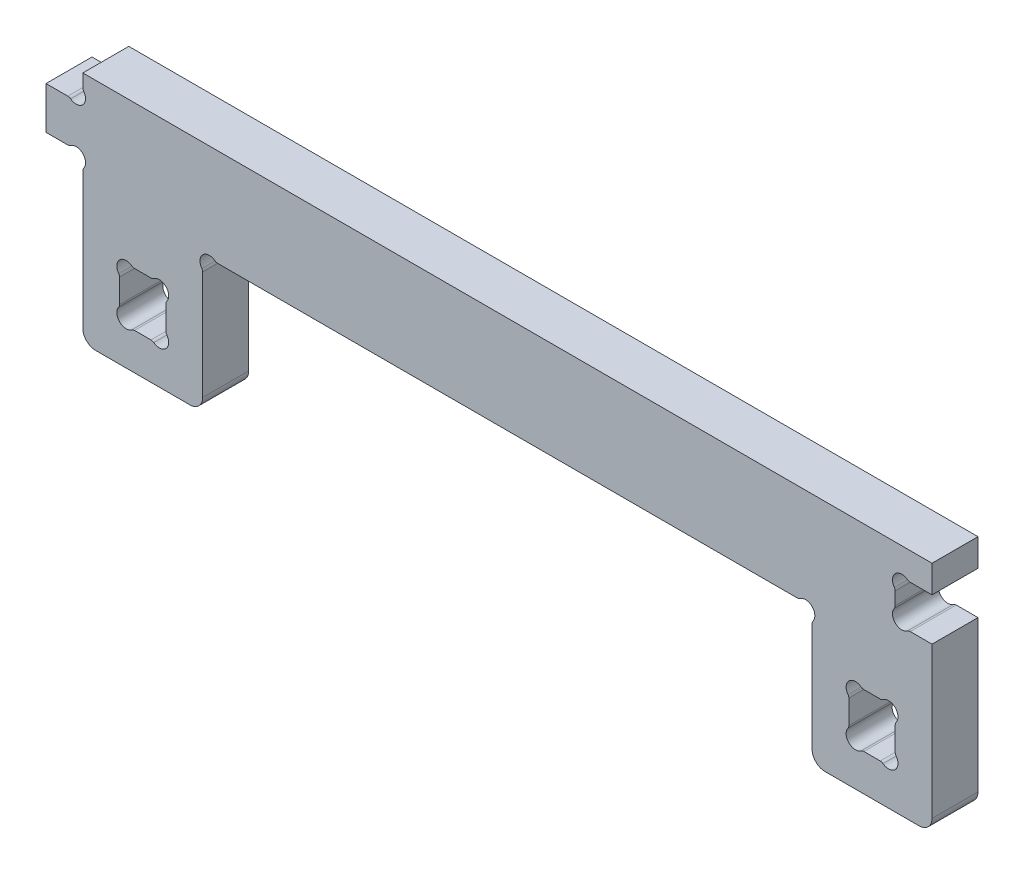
ISO-10303-21;
HEADER;
FILE_DESCRIPTION(('STEP AP214'),'2;1');
FILE_NAME('part.step','',(''),(''),'','','');
FILE_SCHEMA(('AUTOMOTIVE_DESIGN { 1 0 10303 214 1 1 1 1 }'));
ENDSEC;
DATA;
#1=APPLICATION_CONTEXT('core data for automotive mechanical design processes');
#2=APPLICATION_PROTOCOL_DEFINITION('international standard','automotive_design',2000,#1);
#3=PRODUCT_CONTEXT('',#1,'mechanical');
#4=PRODUCT('Part','Part','',(#3));
#5=PRODUCT_RELATED_PRODUCT_CATEGORY('part','',(#4));
#6=PRODUCT_DEFINITION_FORMATION('','',#4);
#7=PRODUCT_DEFINITION_CONTEXT('part definition',#1,'design');
#8=PRODUCT_DEFINITION('design','',#6,#7);
#9=PRODUCT_DEFINITION_SHAPE('','',#8);
#10=(LENGTH_UNIT() NAMED_UNIT(*) SI_UNIT(.MILLI.,.METRE.));
#11=(NAMED_UNIT(*) PLANE_ANGLE_UNIT() SI_UNIT($,.RADIAN.));
#12=(NAMED_UNIT(*) SI_UNIT($,.STERADIAN.) SOLID_ANGLE_UNIT());
#13=UNCERTAINTY_MEASURE_WITH_UNIT(LENGTH_MEASURE(1.E-05),#10,'distance_accuracy_value','');
#14=(GEOMETRIC_REPRESENTATION_CONTEXT(3) GLOBAL_UNCERTAINTY_ASSIGNED_CONTEXT((#13)) GLOBAL_UNIT_ASSIGNED_CONTEXT((#10,
#11,#12)) REPRESENTATION_CONTEXT('',''));
#15=CARTESIAN_POINT('',(0.,0.,0.));
#16=DIRECTION('',(0.,0.,1.));
#17=DIRECTION('',(1.,0.,0.));
#18=AXIS2_PLACEMENT_3D('',#15,#16,#17);
#19=CARTESIAN_POINT('',(2.5,66.0356262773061,25.));
#20=DIRECTION('',(0.,0.,-1.));
#21=DIRECTION('',(-1.,0.,0.));
#22=AXIS2_PLACEMENT_3D('',#19,#20,#21);
#23=PLANE('',#22);
#24=CARTESIAN_POINT('',(17.5,28.1310403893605,25.));
#25=DIRECTION('',(0.,0.,-1.));
#26=DIRECTION('',(1.,0.,0.));
#27=AXIS2_PLACEMENT_3D('',#24,#25,#26);
#28=CIRCLE('',#27,2.5);
#29=CARTESIAN_POINT('',(20.,28.1310403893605,25.));
#30=VERTEX_POINT('',#29);
#31=CARTESIAN_POINT('',(19.508633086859,26.6426207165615,25.));
#32=VERTEX_POINT('',#31);
#33=EDGE_CURVE('E599',#30,#32,#28,.T.);
#34=ORIENTED_EDGE('',*,*,#33,.F.);
#35=DIRECTION('',(0.,-1.,0.));
#36=VECTOR('',#35,1.);
#37=CARTESIAN_POINT('',(20.,41.0356262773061,25.));
#38=LINE('',#37,#36);
#39=CARTESIAN_POINT('',(20.,41.0356262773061,25.));
#40=VERTEX_POINT('',#39);
#41=EDGE_CURVE('E631',#40,#30,#38,.T.);
#42=ORIENTED_EDGE('',*,*,#41,.F.);
#43=CARTESIAN_POINT('',(17.5,41.0356262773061,25.));
#44=DIRECTION('',(0.,0.,-1.));
#45=DIRECTION('',(-1.,0.,0.));
#46=AXIS2_PLACEMENT_3D('',#43,#44,#45);
#47=CIRCLE('',#46,2.5);
#48=CARTESIAN_POINT('',(19.508633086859,42.5240459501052,25.));
#49=VERTEX_POINT('',#48);
#50=EDGE_CURVE('E628',#49,#40,#47,.T.);
#51=ORIENTED_EDGE('',*,*,#50,.F.);
#52=CARTESIAN_POINT('',(23.6062445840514,45.5604220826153,25.));
#53=DIRECTION('',(0.,0.,1.));
#54=DIRECTION('',(-1.,0.,0.));
#55=AXIS2_PLACEMENT_3D('',#52,#53,#54);
#56=CIRCLE('',#55,5.1);
#57=CARTESIAN_POINT('',(26.6426207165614,49.6580335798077,25.));
#58=VERTEX_POINT('',#57);
#59=EDGE_CURVE('E626',#58,#49,#56,.T.);
#60=ORIENTED_EDGE('',*,*,#59,.F.);
#61=CARTESIAN_POINT('',(28.1310403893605,51.6666666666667,25.));
#62=DIRECTION('',(0.,0.,-1.));
#63=DIRECTION('',(1.,0.,0.));
#64=AXIS2_PLACEMENT_3D('',#61,#62,#63);
#65=CIRCLE('',#64,2.50000000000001);
#66=CARTESIAN_POINT('',(28.1310403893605,49.1666666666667,25.));
#67=VERTEX_POINT('',#66);
#68=EDGE_CURVE('E624',#67,#58,#65,.T.);
#69=ORIENTED_EDGE('',*,*,#68,.F.);
#70=DIRECTION('',(-1.,0.,0.));
#71=VECTOR('',#70,1.);
#72=CARTESIAN_POINT('',(28.1310403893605,49.1666666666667,25.));
#73=LINE('',#72,#71);
#74=CARTESIAN_POINT('',(37.0689596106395,49.1666666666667,25.));
#75=VERTEX_POINT('',#74);
#76=EDGE_CURVE('E622',#75,#67,#73,.T.);
#77=ORIENTED_EDGE('',*,*,#76,.F.);
#78=CARTESIAN_POINT('',(37.0689596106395,51.6666666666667,25.));
#79=DIRECTION('',(0.,0.,-1.));
#80=DIRECTION('',(-1.,0.,0.));
#81=AXIS2_PLACEMENT_3D('',#78,#79,#80);
#82=CIRCLE('',#81,2.50000000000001);
#83=CARTESIAN_POINT('',(38.5573792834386,49.6580335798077,25.));
#84=VERTEX_POINT('',#83);
#85=EDGE_CURVE('E620',#84,#75,#82,.T.);
#86=ORIENTED_EDGE('',*,*,#85,.F.);
#87=CARTESIAN_POINT('',(41.5937554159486,45.5604220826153,25.));
#88=DIRECTION('',(0.,0.,1.));
#89=DIRECTION('',(1.,0.,0.));
#90=AXIS2_PLACEMENT_3D('',#87,#88,#89);
#91=CIRCLE('',#90,5.1);
#92=CARTESIAN_POINT('',(45.691366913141,42.5240459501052,25.));
#93=VERTEX_POINT('',#92);
#94=EDGE_CURVE('E618',#93,#84,#91,.T.);
#95=ORIENTED_EDGE('',*,*,#94,.F.);
#96=CARTESIAN_POINT('',(47.7,41.0356262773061,25.));
#97=DIRECTION('',(0.,0.,-1.));
#98=DIRECTION('',(1.,0.,0.));
#99=AXIS2_PLACEMENT_3D('',#96,#97,#98);
#100=CIRCLE('',#99,2.5);
#101=CARTESIAN_POINT('',(45.2,41.0356262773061,25.));
#102=VERTEX_POINT('',#101);
#103=EDGE_CURVE('E616',#102,#93,#100,.T.);
#104=ORIENTED_EDGE('',*,*,#103,.F.);
#105=DIRECTION('',(0.,1.,0.));
#106=VECTOR('',#105,1.);
#107=CARTESIAN_POINT('',(45.2,41.0356262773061,25.));
#108=LINE('',#107,#106);
#109=CARTESIAN_POINT('',(45.2,28.1310403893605,25.));
#110=VERTEX_POINT('',#109);
#111=EDGE_CURVE('E614',#110,#102,#108,.T.);
#112=ORIENTED_EDGE('',*,*,#111,.F.);
#113=CARTESIAN_POINT('',(47.7,28.1310403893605,25.));
#114=DIRECTION('',(0.,0.,-1.));
#115=DIRECTION('',(-1.,0.,0.));
#116=AXIS2_PLACEMENT_3D('',#113,#114,#115);
#117=CIRCLE('',#116,2.5);
#118=CARTESIAN_POINT('',(45.691366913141,26.6426207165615,25.));
#119=VERTEX_POINT('',#118);
#120=EDGE_CURVE('E612',#119,#110,#117,.T.);
#121=ORIENTED_EDGE('',*,*,#120,.F.);
#122=CARTESIAN_POINT('',(41.5937554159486,23.6062445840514,25.));
#123=DIRECTION('',(0.,0.,1.));
#124=DIRECTION('',(-1.,0.,0.));
#125=AXIS2_PLACEMENT_3D('',#122,#123,#124);
#126=CIRCLE('',#125,5.1);
#127=CARTESIAN_POINT('',(38.5573792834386,19.508633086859,25.));
#128=VERTEX_POINT('',#127);
#129=EDGE_CURVE('E610',#128,#119,#126,.T.);
#130=ORIENTED_EDGE('',*,*,#129,.F.);
#131=CARTESIAN_POINT('',(37.0689596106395,17.5,25.));
#132=DIRECTION('',(0.,0.,-1.));
#133=DIRECTION('',(1.,0.,0.));
#134=AXIS2_PLACEMENT_3D('',#131,#132,#133);
#135=CIRCLE('',#134,2.50000000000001);
#136=CARTESIAN_POINT('',(37.0689596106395,20.,25.));
#137=VERTEX_POINT('',#136);
#138=EDGE_CURVE('E608',#137,#128,#135,.T.);
#139=ORIENTED_EDGE('',*,*,#138,.F.);
#140=DIRECTION('',(1.,0.,0.));
#141=VECTOR('',#140,1.);
#142=CARTESIAN_POINT('',(28.1310403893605,20.,25.));
#143=LINE('',#142,#141);
#144=CARTESIAN_POINT('',(28.1310403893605,20.,25.));
#145=VERTEX_POINT('',#144);
#146=EDGE_CURVE('E606',#145,#137,#143,.T.);
#147=ORIENTED_EDGE('',*,*,#146,.F.);
#148=CARTESIAN_POINT('',(28.1310403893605,17.5,25.));
#149=DIRECTION('',(0.,0.,-1.));
#150=DIRECTION('',(-1.,0.,0.));
#151=AXIS2_PLACEMENT_3D('',#148,#149,#150);
#152=CIRCLE('',#151,2.50000000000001);
#153=CARTESIAN_POINT('',(26.6426207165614,19.508633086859,25.));
#154=VERTEX_POINT('',#153);
#155=EDGE_CURVE('E604',#154,#145,#152,.T.);
#156=ORIENTED_EDGE('',*,*,#155,.F.);
#157=CARTESIAN_POINT('',(23.6062445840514,23.6062445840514,25.));
#158=DIRECTION('',(0.,0.,1.));
#159=DIRECTION('',(1.,0.,0.));
#160=AXIS2_PLACEMENT_3D('',#157,#158,#159);
#161=CIRCLE('',#160,5.1);
#162=EDGE_CURVE('E601',#32,#154,#161,.T.);
#163=ORIENTED_EDGE('',*,*,#162,.F.);
#164=EDGE_LOOP('',(#34,#42,#51,#60,#69,#77,#86,#95,#104,#112,#121,#130,#139,#147,#156,#163));
#165=FACE_BOUND('',#164,.T.);
#166=DIRECTION('',(1.,0.,0.));
#167=VECTOR('',#166,1.);
#168=CARTESIAN_POINT('',(-331.24308039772,0.,25.));
#169=LINE('',#168,#167);
#170=CARTESIAN_POINT('',(-389.44308039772,0.,25.));
#171=VERTEX_POINT('',#170);
#172=CARTESIAN_POINT('',(-338.24308039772,0.,25.));
#173=VERTEX_POINT('',#172);
#174=EDGE_CURVE('E766',#171,#173,#169,.T.);
#175=ORIENTED_EDGE('',*,*,#174,.T.);
#176=CARTESIAN_POINT('',(-338.24308039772,6.99999999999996,25.));
#177=DIRECTION('',(0.,0.,-1.));
#178=DIRECTION('',(-1.,0.,0.));
#179=AXIS2_PLACEMENT_3D('',#176,#177,#178);
#180=CIRCLE('',#179,7.);
#181=CARTESIAN_POINT('',(-331.24308039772,6.99999999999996,25.));
#182=VERTEX_POINT('',#181);
#183=EDGE_CURVE('E965',#173,#182,#180,.F.);
#184=ORIENTED_EDGE('',*,*,#183,.T.);
#185=DIRECTION('',(0.,1.,0.));
#186=VECTOR('',#185,1.);
#187=CARTESIAN_POINT('',(-331.24308039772,0.,25.));
#188=LINE('',#187,#186);
#189=CARTESIAN_POINT('',(-331.243080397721,66.0356262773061,25.));
#190=VERTEX_POINT('',#189);
#191=EDGE_CURVE('E769',#182,#190,#188,.T.);
#192=ORIENTED_EDGE('',*,*,#191,.T.);
#193=CARTESIAN_POINT('',(-333.743080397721,66.0356262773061,25.));
#194=DIRECTION('',(0.,0.,1.));
#195=DIRECTION('',(1.,0.,0.));
#196=AXIS2_PLACEMENT_3D('',#193,#194,#195);
#197=CIRCLE('',#196,2.5);
#198=CARTESIAN_POINT('',(-331.734447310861,67.5240459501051,25.));
#199=VERTEX_POINT('',#198);
#200=EDGE_CURVE('E771',#190,#199,#197,.T.);
#201=ORIENTED_EDGE('',*,*,#200,.T.);
#202=CARTESIAN_POINT('',(-327.636835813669,70.5604220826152,25.));
#203=DIRECTION('',(0.,0.,-1.));
#204=DIRECTION('',(-1.,0.,0.));
#205=AXIS2_PLACEMENT_3D('',#202,#203,#204);
#206=CIRCLE('',#205,5.09999999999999);
#207=CARTESIAN_POINT('',(-324.600459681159,74.6580335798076,25.));
#208=VERTEX_POINT('',#207);
#209=EDGE_CURVE('E773',#199,#208,#206,.T.);
#210=ORIENTED_EDGE('',*,*,#209,.T.);
#211=CARTESIAN_POINT('',(-323.11204000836,76.6666666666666,25.));
#212=DIRECTION('',(0.,0.,1.));
#213=DIRECTION('',(1.,0.,0.));
#214=AXIS2_PLACEMENT_3D('',#211,#212,#213);
#215=CIRCLE('',#214,2.50000000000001);
#216=CARTESIAN_POINT('',(-323.11204000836,74.1666666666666,25.));
#217=VERTEX_POINT('',#216);
#218=EDGE_CURVE('E775',#208,#217,#215,.T.);
#219=ORIENTED_EDGE('',*,*,#218,.T.);
#220=DIRECTION('',(1.,0.,0.));
#221=VECTOR('',#220,1.);
#222=CARTESIAN_POINT('',(-8.13104038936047,74.1666666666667,25.));
#223=LINE('',#222,#221);
#224=CARTESIAN_POINT('',(-8.13104038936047,74.1666666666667,25.));
#225=VERTEX_POINT('',#224);
#226=EDGE_CURVE('E777',#217,#225,#223,.T.);
#227=ORIENTED_EDGE('',*,*,#226,.T.);
#228=CARTESIAN_POINT('',(-8.1310403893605,76.6666666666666,25.));
#229=DIRECTION('',(0.,0.,1.));
#230=DIRECTION('',(-1.,0.,0.));
#231=AXIS2_PLACEMENT_3D('',#228,#229,#230);
#232=CIRCLE('',#231,2.5);
#233=CARTESIAN_POINT('',(-6.64262071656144,74.6580335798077,25.));
#234=VERTEX_POINT('',#233);
#235=EDGE_CURVE('E779',#225,#234,#232,.T.);
#236=ORIENTED_EDGE('',*,*,#235,.T.);
#237=CARTESIAN_POINT('',(-3.60624458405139,70.5604220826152,25.));
#238=DIRECTION('',(0.,0.,-1.));
#239=DIRECTION('',(1.,0.,0.));
#240=AXIS2_PLACEMENT_3D('',#237,#238,#239);
#241=CIRCLE('',#240,5.1);
#242=CARTESIAN_POINT('',(0.491366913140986,67.5240459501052,25.));
#243=VERTEX_POINT('',#242);
#244=EDGE_CURVE('E781',#234,#243,#241,.T.);
#245=ORIENTED_EDGE('',*,*,#244,.T.);
#246=CARTESIAN_POINT('',(2.5,66.0356262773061,25.));
#247=DIRECTION('',(0.,0.,1.));
#248=DIRECTION('',(-1.,0.,0.));
#249=AXIS2_PLACEMENT_3D('',#246,#247,#248);
#250=CIRCLE('',#249,2.5);
#251=CARTESIAN_POINT('',(0.,66.0356262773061,25.));
#252=VERTEX_POINT('',#251);
#253=EDGE_CURVE('E783',#243,#252,#250,.T.);
#254=ORIENTED_EDGE('',*,*,#253,.T.);
#255=DIRECTION('',(0.,-1.,0.));
#256=VECTOR('',#255,1.);
#257=CARTESIAN_POINT('',(0.,0.,25.));
#258=LINE('',#257,#256);
#259=CARTESIAN_POINT('',(0.,7.,25.));
#260=VERTEX_POINT('',#259);
#261=EDGE_CURVE('E714',#252,#260,#258,.T.);
#262=ORIENTED_EDGE('',*,*,#261,.T.);
#263=CARTESIAN_POINT('',(7.,7.,25.));
#264=DIRECTION('',(0.,0.,-1.));
#265=DIRECTION('',(-1.,0.,0.));
#266=AXIS2_PLACEMENT_3D('',#263,#264,#265);
#267=CIRCLE('',#266,7.);
#268=CARTESIAN_POINT('',(7.,0.,25.));
#269=VERTEX_POINT('',#268);
#270=EDGE_CURVE('E960',#260,#269,#267,.F.);
#271=ORIENTED_EDGE('',*,*,#270,.T.);
#272=DIRECTION('',(1.,0.,0.));
#273=VECTOR('',#272,1.);
#274=CARTESIAN_POINT('',(0.,0.,25.));
#275=LINE('',#274,#273);
#276=CARTESIAN_POINT('',(58.2,0.,25.));
#277=VERTEX_POINT('',#276);
#278=EDGE_CURVE('E717',#269,#277,#275,.T.);
#279=ORIENTED_EDGE('',*,*,#278,.T.);
#280=CARTESIAN_POINT('',(58.2,6.99999999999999,25.));
#281=DIRECTION('',(0.,0.,-1.));
#282=DIRECTION('',(-1.,0.,0.));
#283=AXIS2_PLACEMENT_3D('',#280,#281,#282);
#284=CIRCLE('',#283,7.);
#285=CARTESIAN_POINT('',(65.2,7.00000000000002,25.));
#286=VERTEX_POINT('',#285);
#287=EDGE_CURVE('E56',#277,#286,#284,.F.);
#288=ORIENTED_EDGE('',*,*,#287,.T.);
#289=DIRECTION('',(0.,1.,0.));
#290=VECTOR('',#289,1.);
#291=CARTESIAN_POINT('',(65.2,89.0666666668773,25.));
#292=LINE('',#291,#290);
#293=CARTESIAN_POINT('',(65.2,89.0666666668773,25.));
#294=VERTEX_POINT('',#293);
#295=EDGE_CURVE('E720',#286,#294,#292,.T.);
#296=ORIENTED_EDGE('',*,*,#295,.T.);
#297=DIRECTION('',(-1.,0.,0.));
#298=VECTOR('',#297,1.);
#299=CARTESIAN_POINT('',(65.2,89.0666666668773,25.));
#300=LINE('',#299,#298);
#301=CARTESIAN_POINT('',(53.3310403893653,89.0666666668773,25.));
#302=VERTEX_POINT('',#301);
#303=EDGE_CURVE('E722',#294,#302,#300,.T.);
#304=ORIENTED_EDGE('',*,*,#303,.T.);
#305=CARTESIAN_POINT('',(53.3310403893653,86.5666666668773,25.));
#306=DIRECTION('',(0.,0.,1.));
#307=DIRECTION('',(1.,0.,0.));
#308=AXIS2_PLACEMENT_3D('',#305,#306,#307);
#309=CIRCLE('',#308,2.49999999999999);
#310=CARTESIAN_POINT('',(51.8426207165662,88.5752997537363,25.));
#311=VERTEX_POINT('',#310);
#312=EDGE_CURVE('E724',#302,#311,#309,.T.);
#313=ORIENTED_EDGE('',*,*,#312,.T.);
#314=CARTESIAN_POINT('',(48.8062445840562,92.6729112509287,25.));
#315=DIRECTION('',(0.,0.,-1.));
#316=DIRECTION('',(1.,0.,0.));
#317=AXIS2_PLACEMENT_3D('',#314,#315,#316);
#318=CIRCLE('',#317,5.1);
#319=CARTESIAN_POINT('',(44.7086330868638,95.7092873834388,25.));
#320=VERTEX_POINT('',#319);
#321=EDGE_CURVE('E726',#311,#320,#318,.T.);
#322=ORIENTED_EDGE('',*,*,#321,.T.);
#323=CARTESIAN_POINT('',(42.7000000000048,97.1977070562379,25.));
#324=DIRECTION('',(0.,0.,1.));
#325=DIRECTION('',(1.,0.,0.));
#326=AXIS2_PLACEMENT_3D('',#323,#324,#325);
#327=CIRCLE('',#326,2.5);
#328=CARTESIAN_POINT('',(45.2000000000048,97.1977070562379,25.));
#329=VERTEX_POINT('',#328);
#330=EDGE_CURVE('E728',#320,#329,#327,.T.);
#331=ORIENTED_EDGE('',*,*,#330,.T.);
#332=DIRECTION('',(0.,1.,0.));
#333=VECTOR('',#332,1.);
#334=CARTESIAN_POINT('',(45.2000000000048,97.1977070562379,25.));
#335=LINE('',#334,#333);
#336=CARTESIAN_POINT('',(45.2000000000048,104.135626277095,25.));
#337=VERTEX_POINT('',#336);
#338=EDGE_CURVE('E730',#329,#337,#335,.T.);
#339=ORIENTED_EDGE('',*,*,#338,.T.);
#340=CARTESIAN_POINT('',(42.7000000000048,104.135626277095,25.));
#341=DIRECTION('',(0.,0.,1.));
#342=DIRECTION('',(-1.,0.,0.));
#343=AXIS2_PLACEMENT_3D('',#340,#341,#342);
#344=CIRCLE('',#343,2.5);
#345=CARTESIAN_POINT('',(44.7086330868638,105.624045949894,25.));
#346=VERTEX_POINT('',#345);
#347=EDGE_CURVE('E732',#337,#346,#344,.T.);
#348=ORIENTED_EDGE('',*,*,#347,.T.);
#349=CARTESIAN_POINT('',(48.8062445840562,108.660422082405,25.));
#350=DIRECTION('',(0.,0.,-1.));
#351=DIRECTION('',(-1.,0.,0.));
#352=AXIS2_PLACEMENT_3D('',#349,#350,#351);
#353=CIRCLE('',#352,5.1);
#354=CARTESIAN_POINT('',(51.8426207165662,112.758033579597,25.));
#355=VERTEX_POINT('',#354);
#356=EDGE_CURVE('E734',#346,#355,#353,.T.);
#357=ORIENTED_EDGE('',*,*,#356,.T.);
#358=CARTESIAN_POINT('',(53.3310403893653,114.766666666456,25.));
#359=DIRECTION('',(0.,0.,1.));
#360=DIRECTION('',(-1.,0.,0.));
#361=AXIS2_PLACEMENT_3D('',#358,#359,#360);
#362=CIRCLE('',#361,2.49999999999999);
#363=CARTESIAN_POINT('',(53.3310403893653,112.266666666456,25.));
#364=VERTEX_POINT('',#363);
#365=EDGE_CURVE('E736',#355,#364,#362,.T.);
#366=ORIENTED_EDGE('',*,*,#365,.T.);
#367=DIRECTION('',(1.,0.,0.));
#368=VECTOR('',#367,1.);
#369=CARTESIAN_POINT('',(65.2,112.266666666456,25.));
#370=LINE('',#369,#368);
#371=CARTESIAN_POINT('',(65.2,112.266666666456,25.));
#372=VERTEX_POINT('',#371);
#373=EDGE_CURVE('E738',#364,#372,#370,.T.);
#374=ORIENTED_EDGE('',*,*,#373,.T.);
#375=DIRECTION('',(0.,1.,0.));
#376=VECTOR('',#375,1.);
#377=CARTESIAN_POINT('',(65.2,127.166666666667,25.));
#378=LINE('',#377,#376);
#379=CARTESIAN_POINT('',(65.2,127.166666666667,25.));
#380=VERTEX_POINT('',#379);
#381=EDGE_CURVE('E740',#372,#380,#378,.T.);
#382=ORIENTED_EDGE('',*,*,#381,.T.);
#383=DIRECTION('',(-1.,0.,0.));
#384=VECTOR('',#383,1.);
#385=CARTESIAN_POINT('',(-396.44308039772,127.166666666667,25.));
#386=LINE('',#385,#384);
#387=CARTESIAN_POINT('',(-396.44308039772,127.166666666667,25.));
#388=VERTEX_POINT('',#387);
#389=EDGE_CURVE('E742',#380,#388,#386,.T.);
#390=ORIENTED_EDGE('',*,*,#389,.T.);
#391=DIRECTION('',(0.,-1.,0.));
#392=VECTOR('',#391,1.);
#393=CARTESIAN_POINT('',(-396.44308039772,127.166666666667,25.));
#394=LINE('',#393,#392);
#395=CARTESIAN_POINT('',(-396.44308039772,120.297707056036,25.));
#396=VERTEX_POINT('',#395);
#397=EDGE_CURVE('E744',#388,#396,#394,.T.);
#398=ORIENTED_EDGE('',*,*,#397,.T.);
#399=CARTESIAN_POINT('',(-393.94308039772,120.297707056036,25.));
#400=DIRECTION('',(0.,0.,1.));
#401=DIRECTION('',(-1.,0.,0.));
#402=AXIS2_PLACEMENT_3D('',#399,#400,#401);
#403=CIRCLE('',#402,2.50000000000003);
#404=CARTESIAN_POINT('',(-395.951713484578,118.809287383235,25.));
#405=VERTEX_POINT('',#404);
#406=EDGE_CURVE('E746',#396,#405,#403,.T.);
#407=ORIENTED_EDGE('',*,*,#406,.T.);
#408=CARTESIAN_POINT('',(-400.049324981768,115.772911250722,25.));
#409=DIRECTION('',(0.,0.,-1.));
#410=DIRECTION('',(-1.,0.,0.));
#411=AXIS2_PLACEMENT_3D('',#408,#409,#410);
#412=CIRCLE('',#411,5.1);
#413=CARTESIAN_POINT('',(-403.085701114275,111.675299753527,25.));
#414=VERTEX_POINT('',#413);
#415=EDGE_CURVE('E748',#405,#414,#412,.T.);
#416=ORIENTED_EDGE('',*,*,#415,.T.);
#417=CARTESIAN_POINT('',(-404.574120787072,109.666666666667,25.));
#418=DIRECTION('',(0.,0.,1.));
#419=DIRECTION('',(-1.,0.,0.));
#420=AXIS2_PLACEMENT_3D('',#417,#418,#419);
#421=CIRCLE('',#420,2.49999999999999);
#422=CARTESIAN_POINT('',(-404.574120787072,112.166666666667,25.));
#423=VERTEX_POINT('',#422);
#424=EDGE_CURVE('E750',#414,#423,#421,.T.);
#425=ORIENTED_EDGE('',*,*,#424,.T.);
#426=DIRECTION('',(-1.,0.,0.));
#427=VECTOR('',#426,1.);
#428=CARTESIAN_POINT('',(-404.574120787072,112.166666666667,25.));
#429=LINE('',#428,#427);
#430=CARTESIAN_POINT('',(-416.443080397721,112.166666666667,25.));
#431=VERTEX_POINT('',#430);
#432=EDGE_CURVE('E752',#423,#431,#429,.T.);
#433=ORIENTED_EDGE('',*,*,#432,.T.);
#434=DIRECTION('',(0.,-1.,0.));
#435=VECTOR('',#434,1.);
#436=CARTESIAN_POINT('',(-416.443080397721,89.1666666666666,25.));
#437=LINE('',#436,#435);
#438=CARTESIAN_POINT('',(-416.443080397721,89.1666666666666,25.));
#439=VERTEX_POINT('',#438);
#440=EDGE_CURVE('E754',#431,#439,#437,.T.);
#441=ORIENTED_EDGE('',*,*,#440,.T.);
#442=DIRECTION('',(1.,0.,0.));
#443=VECTOR('',#442,1.);
#444=CARTESIAN_POINT('',(-404.574120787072,89.1666666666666,25.));
#445=LINE('',#444,#443);
#446=CARTESIAN_POINT('',(-404.574120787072,89.1666666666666,25.));
#447=VERTEX_POINT('',#446);
#448=EDGE_CURVE('E756',#439,#447,#445,.T.);
#449=ORIENTED_EDGE('',*,*,#448,.T.);
#450=CARTESIAN_POINT('',(-404.574120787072,91.6666666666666,25.));
#451=DIRECTION('',(0.,0.,1.));
#452=DIRECTION('',(1.,0.,0.));
#453=AXIS2_PLACEMENT_3D('',#450,#451,#452);
#454=CIRCLE('',#453,2.49999999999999);
#455=CARTESIAN_POINT('',(-403.085701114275,89.6580335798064,25.));
#456=VERTEX_POINT('',#455);
#457=EDGE_CURVE('E758',#447,#456,#454,.T.);
#458=ORIENTED_EDGE('',*,*,#457,.T.);
#459=CARTESIAN_POINT('',(-400.049324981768,85.5604220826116,25.));
#460=DIRECTION('',(0.,0.,-1.));
#461=DIRECTION('',(1.,0.,0.));
#462=AXIS2_PLACEMENT_3D('',#459,#460,#461);
#463=CIRCLE('',#462,5.1);
#464=CARTESIAN_POINT('',(-395.951713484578,82.5240459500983,25.));
#465=VERTEX_POINT('',#464);
#466=EDGE_CURVE('E760',#456,#465,#463,.T.);
#467=ORIENTED_EDGE('',*,*,#466,.T.);
#468=CARTESIAN_POINT('',(-393.94308039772,81.0356262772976,25.));
#469=DIRECTION('',(0.,0.,1.));
#470=DIRECTION('',(1.,0.,0.));
#471=AXIS2_PLACEMENT_3D('',#468,#469,#470);
#472=CIRCLE('',#471,2.50000000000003);
#473=CARTESIAN_POINT('',(-396.44308039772,81.0356262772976,25.));
#474=VERTEX_POINT('',#473);
#475=EDGE_CURVE('E762',#465,#474,#472,.T.);
#476=ORIENTED_EDGE('',*,*,#475,.T.);
#477=DIRECTION('',(0.,-1.,0.));
#478=VECTOR('',#477,1.);
#479=CARTESIAN_POINT('',(-396.44308039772,81.0356262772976,25.));
#480=LINE('',#479,#478);
#481=CARTESIAN_POINT('',(-396.44308039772,6.99999999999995,25.));
#482=VERTEX_POINT('',#481);
#483=EDGE_CURVE('E764',#474,#482,#480,.T.);
#484=ORIENTED_EDGE('',*,*,#483,.T.);
#485=CARTESIAN_POINT('',(-389.44308039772,6.99999999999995,25.));
#486=DIRECTION('',(0.,0.,-1.));
#487=DIRECTION('',(-1.,0.,0.));
#488=AXIS2_PLACEMENT_3D('',#485,#486,#487);
#489=CIRCLE('',#488,7.);
#490=EDGE_CURVE('E963',#482,#171,#489,.F.);
#491=ORIENTED_EDGE('',*,*,#490,.T.);
#492=EDGE_LOOP('',(#175,#184,#192,#201,#210,#219,#227,#236,#245,#254,#262,#271,#279,#288,#296,
#304,#313,#322,#331,#339,#348,#357,#366,#374,#382,#390,#398,#407,#416,#425,#433,#441,#449,#458,
#467,#476,#484,#491));
#493=FACE_BOUND('',#492,.T.);
#494=CARTESIAN_POINT('',(-372.836835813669,45.5604220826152,25.));
#495=DIRECTION('',(0.,0.,1.));
#496=DIRECTION('',(-1.,0.,0.));
#497=AXIS2_PLACEMENT_3D('',#494,#495,#496);
#498=CIRCLE('',#497,5.09999999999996);
#499=CARTESIAN_POINT('',(-369.800459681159,49.6580335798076,25.));
#500=VERTEX_POINT('',#499);
#501=CARTESIAN_POINT('',(-376.934447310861,42.5240459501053,25.));
#502=VERTEX_POINT('',#501);
#503=EDGE_CURVE('E473',#500,#502,#498,.T.);
#504=ORIENTED_EDGE('',*,*,#503,.F.);
#505=CARTESIAN_POINT('',(-368.31204000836,51.6666666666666,25.));
#506=DIRECTION('',(0.,0.,-1.));
#507=DIRECTION('',(1.,0.,0.));
#508=AXIS2_PLACEMENT_3D('',#505,#506,#507);
#509=CIRCLE('',#508,2.5);
#510=CARTESIAN_POINT('',(-368.31204000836,49.1666666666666,25.));
#511=VERTEX_POINT('',#510);
#512=EDGE_CURVE('E525',#511,#500,#509,.T.);
#513=ORIENTED_EDGE('',*,*,#512,.F.);
#514=DIRECTION('',(-1.,0.,0.));
#515=VECTOR('',#514,1.);
#516=CARTESIAN_POINT('',(-359.374120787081,49.1666666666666,25.));
#517=LINE('',#516,#515);
#518=CARTESIAN_POINT('',(-359.374120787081,49.1666666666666,25.));
#519=VERTEX_POINT('',#518);
#520=EDGE_CURVE('E522',#519,#511,#517,.T.);
#521=ORIENTED_EDGE('',*,*,#520,.F.);
#522=CARTESIAN_POINT('',(-359.374120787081,51.6666666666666,25.));
#523=DIRECTION('',(0.,0.,-1.));
#524=DIRECTION('',(-1.,0.,0.));
#525=AXIS2_PLACEMENT_3D('',#522,#523,#524);
#526=CIRCLE('',#525,2.5);
#527=CARTESIAN_POINT('',(-357.885701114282,49.6580335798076,25.));
#528=VERTEX_POINT('',#527);
#529=EDGE_CURVE('E520',#528,#519,#526,.T.);
#530=ORIENTED_EDGE('',*,*,#529,.F.);
#531=CARTESIAN_POINT('',(-354.849324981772,45.5604220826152,25.));
#532=DIRECTION('',(0.,0.,1.));
#533=DIRECTION('',(1.,0.,0.));
#534=AXIS2_PLACEMENT_3D('',#531,#532,#533);
#535=CIRCLE('',#534,5.10000000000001);
#536=CARTESIAN_POINT('',(-350.75171348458,42.5240459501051,25.));
#537=VERTEX_POINT('',#536);
#538=EDGE_CURVE('E518',#537,#528,#535,.T.);
#539=ORIENTED_EDGE('',*,*,#538,.F.);
#540=CARTESIAN_POINT('',(-348.74308039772,41.0356262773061,25.));
#541=DIRECTION('',(0.,0.,-1.));
#542=DIRECTION('',(1.,0.,0.));
#543=AXIS2_PLACEMENT_3D('',#540,#541,#542);
#544=CIRCLE('',#543,2.50000000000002);
#545=CARTESIAN_POINT('',(-351.24308039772,41.0356262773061,25.));
#546=VERTEX_POINT('',#545);
#547=EDGE_CURVE('E516',#546,#537,#544,.T.);
#548=ORIENTED_EDGE('',*,*,#547,.F.);
#549=DIRECTION('',(0.,1.,0.));
#550=VECTOR('',#549,1.);
#551=CARTESIAN_POINT('',(-351.24308039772,41.0356262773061,25.));
#552=LINE('',#551,#550);
#553=CARTESIAN_POINT('',(-351.24308039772,28.1310403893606,25.));
#554=VERTEX_POINT('',#553);
#555=EDGE_CURVE('E514',#554,#546,#552,.T.);
#556=ORIENTED_EDGE('',*,*,#555,.F.);
#557=CARTESIAN_POINT('',(-348.74308039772,28.1310403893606,25.));
#558=DIRECTION('',(0.,0.,-1.));
#559=DIRECTION('',(-1.,0.,0.));
#560=AXIS2_PLACEMENT_3D('',#557,#558,#559);
#561=CIRCLE('',#560,2.50000000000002);
#562=CARTESIAN_POINT('',(-350.75171348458,26.6426207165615,25.));
#563=VERTEX_POINT('',#562);
#564=EDGE_CURVE('E512',#563,#554,#561,.T.);
#565=ORIENTED_EDGE('',*,*,#564,.F.);
#566=CARTESIAN_POINT('',(-354.849324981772,23.6062445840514,25.));
#567=DIRECTION('',(0.,0.,1.));
#568=DIRECTION('',(-1.,0.,0.));
#569=AXIS2_PLACEMENT_3D('',#566,#567,#568);
#570=CIRCLE('',#569,5.10000000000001);
#571=CARTESIAN_POINT('',(-357.885701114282,19.5086330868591,25.));
#572=VERTEX_POINT('',#571);
#573=EDGE_CURVE('E510',#572,#563,#570,.T.);
#574=ORIENTED_EDGE('',*,*,#573,.F.);
#575=CARTESIAN_POINT('',(-359.374120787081,17.5,25.));
#576=DIRECTION('',(0.,0.,-1.));
#577=DIRECTION('',(1.,0.,0.));
#578=AXIS2_PLACEMENT_3D('',#575,#576,#577);
#579=CIRCLE('',#578,2.5);
#580=CARTESIAN_POINT('',(-359.374120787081,20.,25.));
#581=VERTEX_POINT('',#580);
#582=EDGE_CURVE('E508',#581,#572,#579,.T.);
#583=ORIENTED_EDGE('',*,*,#582,.F.);
#584=DIRECTION('',(1.,0.,0.));
#585=VECTOR('',#584,1.);
#586=CARTESIAN_POINT('',(-359.374120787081,20.,25.));
#587=LINE('',#586,#585);
#588=CARTESIAN_POINT('',(-368.31204000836,20.,25.));
#589=VERTEX_POINT('',#588);
#590=EDGE_CURVE('E506',#589,#581,#587,.T.);
#591=ORIENTED_EDGE('',*,*,#590,.F.);
#592=CARTESIAN_POINT('',(-368.31204000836,17.5,25.));
#593=DIRECTION('',(0.,0.,-1.));
#594=DIRECTION('',(-1.,0.,0.));
#595=AXIS2_PLACEMENT_3D('',#592,#593,#594);
#596=CIRCLE('',#595,2.5);
#597=CARTESIAN_POINT('',(-369.800459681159,19.5086330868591,25.));
#598=VERTEX_POINT('',#597);
#599=EDGE_CURVE('E504',#598,#589,#596,.T.);
#600=ORIENTED_EDGE('',*,*,#599,.F.);
#601=CARTESIAN_POINT('',(-372.836835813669,23.6062445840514,25.));
#602=DIRECTION('',(0.,0.,1.));
#603=DIRECTION('',(1.,0.,0.));
#604=AXIS2_PLACEMENT_3D('',#601,#602,#603);
#605=CIRCLE('',#604,5.09999999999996);
#606=CARTESIAN_POINT('',(-376.934447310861,26.6426207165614,25.));
#607=VERTEX_POINT('',#606);
#608=EDGE_CURVE('E502',#607,#598,#605,.T.);
#609=ORIENTED_EDGE('',*,*,#608,.F.);
#610=CARTESIAN_POINT('',(-378.943080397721,28.1310403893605,25.));
#611=DIRECTION('',(0.,0.,-1.));
#612=DIRECTION('',(1.,0.,0.));
#613=AXIS2_PLACEMENT_3D('',#610,#611,#612);
#614=CIRCLE('',#613,2.50000000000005);
#615=CARTESIAN_POINT('',(-376.44308039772,28.1310403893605,25.));
#616=VERTEX_POINT('',#615);
#617=EDGE_CURVE('E498',#616,#607,#614,.T.);
#618=ORIENTED_EDGE('',*,*,#617,.F.);
#619=DIRECTION('',(0.,-1.,0.));
#620=VECTOR('',#619,1.);
#621=CARTESIAN_POINT('',(-376.44308039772,41.0356262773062,25.));
#622=LINE('',#621,#620);
#623=CARTESIAN_POINT('',(-376.44308039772,41.0356262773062,25.));
#624=VERTEX_POINT('',#623);
#625=EDGE_CURVE('E496',#624,#616,#622,.T.);
#626=ORIENTED_EDGE('',*,*,#625,.F.);
#627=CARTESIAN_POINT('',(-378.943080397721,41.0356262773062,25.));
#628=DIRECTION('',(0.,0.,-1.));
#629=DIRECTION('',(-1.,0.,0.));
#630=AXIS2_PLACEMENT_3D('',#627,#628,#629);
#631=CIRCLE('',#630,2.50000000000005);
#632=EDGE_CURVE('E483',#502,#624,#631,.T.);
#633=ORIENTED_EDGE('',*,*,#632,.F.);
#634=EDGE_LOOP('',(#504,#513,#521,#530,#539,#548,#556,#565,#574,#583,#591,#600,#609,#618,#626,#633));
#635=FACE_BOUND('',#634,.T.);
#636=ADVANCED_FACE('F33',(#165,#493,#635),#23,.F.);
#637=CARTESIAN_POINT('',(2.5,66.0356262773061,0.));
#638=DIRECTION('',(0.,0.,-1.));
#639=DIRECTION('',(-1.,0.,0.));
#640=AXIS2_PLACEMENT_3D('',#637,#638,#639);
#641=PLANE('',#640);
#642=DIRECTION('',(0.,1.,0.));
#643=VECTOR('',#642,1.);
#644=CARTESIAN_POINT('',(-331.24308039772,0.,0.));
#645=LINE('',#644,#643);
#646=CARTESIAN_POINT('',(-331.24308039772,6.99999999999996,0.));
#647=VERTEX_POINT('',#646);
#648=CARTESIAN_POINT('',(-331.243080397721,66.0356262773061,0.));
#649=VERTEX_POINT('',#648);
#650=EDGE_CURVE('E840',#647,#649,#645,.T.);
#651=ORIENTED_EDGE('',*,*,#650,.F.);
#652=CARTESIAN_POINT('',(-338.24308039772,6.99999999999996,0.));
#653=DIRECTION('',(0.,0.,-1.));
#654=DIRECTION('',(-1.,0.,0.));
#655=AXIS2_PLACEMENT_3D('',#652,#653,#654);
#656=CIRCLE('',#655,7.);
#657=CARTESIAN_POINT('',(-338.24308039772,0.,0.));
#658=VERTEX_POINT('',#657);
#659=EDGE_CURVE('E953',#647,#658,#656,.T.);
#660=ORIENTED_EDGE('',*,*,#659,.T.);
#661=DIRECTION('',(1.,0.,0.));
#662=VECTOR('',#661,1.);
#663=CARTESIAN_POINT('',(-331.24308039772,0.,0.));
#664=LINE('',#663,#662);
#665=CARTESIAN_POINT('',(-389.44308039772,0.,0.));
#666=VERTEX_POINT('',#665);
#667=EDGE_CURVE('E837',#666,#658,#664,.T.);
#668=ORIENTED_EDGE('',*,*,#667,.F.);
#669=CARTESIAN_POINT('',(-389.44308039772,6.99999999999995,0.));
#670=DIRECTION('',(0.,0.,-1.));
#671=DIRECTION('',(-1.,0.,0.));
#672=AXIS2_PLACEMENT_3D('',#669,#670,#671);
#673=CIRCLE('',#672,7.);
#674=CARTESIAN_POINT('',(-396.44308039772,6.99999999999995,0.));
#675=VERTEX_POINT('',#674);
#676=EDGE_CURVE('E951',#666,#675,#673,.T.);
#677=ORIENTED_EDGE('',*,*,#676,.T.);
#678=DIRECTION('',(0.,-1.,0.));
#679=VECTOR('',#678,1.);
#680=CARTESIAN_POINT('',(-396.44308039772,81.0356262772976,0.));
#681=LINE('',#680,#679);
#682=CARTESIAN_POINT('',(-396.44308039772,81.0356262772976,0.));
#683=VERTEX_POINT('',#682);
#684=EDGE_CURVE('E835',#683,#675,#681,.T.);
#685=ORIENTED_EDGE('',*,*,#684,.F.);
#686=CARTESIAN_POINT('',(-393.94308039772,81.0356262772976,0.));
#687=DIRECTION('',(0.,0.,1.));
#688=DIRECTION('',(1.,0.,0.));
#689=AXIS2_PLACEMENT_3D('',#686,#687,#688);
#690=CIRCLE('',#689,2.50000000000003);
#691=CARTESIAN_POINT('',(-395.951713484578,82.5240459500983,0.));
#692=VERTEX_POINT('',#691);
#693=EDGE_CURVE('E833',#692,#683,#690,.T.);
#694=ORIENTED_EDGE('',*,*,#693,.F.);
#695=CARTESIAN_POINT('',(-400.049324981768,85.5604220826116,0.));
#696=DIRECTION('',(0.,0.,-1.));
#697=DIRECTION('',(1.,0.,0.));
#698=AXIS2_PLACEMENT_3D('',#695,#696,#697);
#699=CIRCLE('',#698,5.1);
#700=CARTESIAN_POINT('',(-403.085701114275,89.6580335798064,0.));
#701=VERTEX_POINT('',#700);
#702=EDGE_CURVE('E831',#701,#692,#699,.T.);
#703=ORIENTED_EDGE('',*,*,#702,.F.);
#704=CARTESIAN_POINT('',(-404.574120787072,91.6666666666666,0.));
#705=DIRECTION('',(0.,0.,1.));
#706=DIRECTION('',(1.,0.,0.));
#707=AXIS2_PLACEMENT_3D('',#704,#705,#706);
#708=CIRCLE('',#707,2.49999999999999);
#709=CARTESIAN_POINT('',(-404.574120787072,89.1666666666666,0.));
#710=VERTEX_POINT('',#709);
#711=EDGE_CURVE('E829',#710,#701,#708,.T.);
#712=ORIENTED_EDGE('',*,*,#711,.F.);
#713=DIRECTION('',(1.,0.,0.));
#714=VECTOR('',#713,1.);
#715=CARTESIAN_POINT('',(-404.574120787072,89.1666666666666,0.));
#716=LINE('',#715,#714);
#717=CARTESIAN_POINT('',(-416.443080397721,89.1666666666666,0.));
#718=VERTEX_POINT('',#717);
#719=EDGE_CURVE('E827',#718,#710,#716,.T.);
#720=ORIENTED_EDGE('',*,*,#719,.F.);
#721=DIRECTION('',(0.,-1.,0.));
#722=VECTOR('',#721,1.);
#723=CARTESIAN_POINT('',(-416.443080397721,89.1666666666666,0.));
#724=LINE('',#723,#722);
#725=CARTESIAN_POINT('',(-416.443080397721,112.166666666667,0.));
#726=VERTEX_POINT('',#725);
#727=EDGE_CURVE('E825',#726,#718,#724,.T.);
#728=ORIENTED_EDGE('',*,*,#727,.F.);
#729=DIRECTION('',(-1.,0.,0.));
#730=VECTOR('',#729,1.);
#731=CARTESIAN_POINT('',(-404.574120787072,112.166666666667,0.));
#732=LINE('',#731,#730);
#733=CARTESIAN_POINT('',(-404.574120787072,112.166666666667,0.));
#734=VERTEX_POINT('',#733);
#735=EDGE_CURVE('E823',#734,#726,#732,.T.);
#736=ORIENTED_EDGE('',*,*,#735,.F.);
#737=CARTESIAN_POINT('',(-404.574120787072,109.666666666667,0.));
#738=DIRECTION('',(0.,0.,1.));
#739=DIRECTION('',(-1.,0.,0.));
#740=AXIS2_PLACEMENT_3D('',#737,#738,#739);
#741=CIRCLE('',#740,2.49999999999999);
#742=CARTESIAN_POINT('',(-403.085701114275,111.675299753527,0.));
#743=VERTEX_POINT('',#742);
#744=EDGE_CURVE('E821',#743,#734,#741,.T.);
#745=ORIENTED_EDGE('',*,*,#744,.F.);
#746=CARTESIAN_POINT('',(-400.049324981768,115.772911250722,0.));
#747=DIRECTION('',(0.,0.,-1.));
#748=DIRECTION('',(-1.,0.,0.));
#749=AXIS2_PLACEMENT_3D('',#746,#747,#748);
#750=CIRCLE('',#749,5.1);
#751=CARTESIAN_POINT('',(-395.951713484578,118.809287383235,0.));
#752=VERTEX_POINT('',#751);
#753=EDGE_CURVE('E819',#752,#743,#750,.T.);
#754=ORIENTED_EDGE('',*,*,#753,.F.);
#755=CARTESIAN_POINT('',(-393.94308039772,120.297707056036,0.));
#756=DIRECTION('',(0.,0.,1.));
#757=DIRECTION('',(-1.,0.,0.));
#758=AXIS2_PLACEMENT_3D('',#755,#756,#757);
#759=CIRCLE('',#758,2.50000000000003);
#760=CARTESIAN_POINT('',(-396.44308039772,120.297707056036,0.));
#761=VERTEX_POINT('',#760);
#762=EDGE_CURVE('E817',#761,#752,#759,.T.);
#763=ORIENTED_EDGE('',*,*,#762,.F.);
#764=DIRECTION('',(0.,-1.,0.));
#765=VECTOR('',#764,1.);
#766=CARTESIAN_POINT('',(-396.44308039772,127.166666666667,0.));
#767=LINE('',#766,#765);
#768=CARTESIAN_POINT('',(-396.44308039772,127.166666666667,0.));
#769=VERTEX_POINT('',#768);
#770=EDGE_CURVE('E815',#769,#761,#767,.T.);
#771=ORIENTED_EDGE('',*,*,#770,.F.);
#772=DIRECTION('',(-1.,0.,0.));
#773=VECTOR('',#772,1.);
#774=CARTESIAN_POINT('',(-396.44308039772,127.166666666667,0.));
#775=LINE('',#774,#773);
#776=CARTESIAN_POINT('',(65.2,127.166666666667,0.));
#777=VERTEX_POINT('',#776);
#778=EDGE_CURVE('E813',#777,#769,#775,.T.);
#779=ORIENTED_EDGE('',*,*,#778,.F.);
#780=DIRECTION('',(0.,1.,0.));
#781=VECTOR('',#780,1.);
#782=CARTESIAN_POINT('',(65.2,127.166666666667,0.));
#783=LINE('',#782,#781);
#784=CARTESIAN_POINT('',(65.2,112.266666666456,0.));
#785=VERTEX_POINT('',#784);
#786=EDGE_CURVE('E811',#785,#777,#783,.T.);
#787=ORIENTED_EDGE('',*,*,#786,.F.);
#788=DIRECTION('',(1.,0.,0.));
#789=VECTOR('',#788,1.);
#790=CARTESIAN_POINT('',(65.2,112.266666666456,0.));
#791=LINE('',#790,#789);
#792=CARTESIAN_POINT('',(53.3310403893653,112.266666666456,0.));
#793=VERTEX_POINT('',#792);
#794=EDGE_CURVE('E809',#793,#785,#791,.T.);
#795=ORIENTED_EDGE('',*,*,#794,.F.);
#796=CARTESIAN_POINT('',(53.3310403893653,114.766666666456,0.));
#797=DIRECTION('',(0.,0.,1.));
#798=DIRECTION('',(-1.,0.,0.));
#799=AXIS2_PLACEMENT_3D('',#796,#797,#798);
#800=CIRCLE('',#799,2.49999999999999);
#801=CARTESIAN_POINT('',(51.8426207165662,112.758033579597,0.));
#802=VERTEX_POINT('',#801);
#803=EDGE_CURVE('E807',#802,#793,#800,.T.);
#804=ORIENTED_EDGE('',*,*,#803,.F.);
#805=CARTESIAN_POINT('',(48.8062445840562,108.660422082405,0.));
#806=DIRECTION('',(0.,0.,-1.));
#807=DIRECTION('',(-1.,0.,0.));
#808=AXIS2_PLACEMENT_3D('',#805,#806,#807);
#809=CIRCLE('',#808,5.1);
#810=CARTESIAN_POINT('',(44.7086330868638,105.624045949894,0.));
#811=VERTEX_POINT('',#810);
#812=EDGE_CURVE('E805',#811,#802,#809,.T.);
#813=ORIENTED_EDGE('',*,*,#812,.F.);
#814=CARTESIAN_POINT('',(42.7000000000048,104.135626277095,0.));
#815=DIRECTION('',(0.,0.,1.));
#816=DIRECTION('',(-1.,0.,0.));
#817=AXIS2_PLACEMENT_3D('',#814,#815,#816);
#818=CIRCLE('',#817,2.5);
#819=CARTESIAN_POINT('',(45.2000000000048,104.135626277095,0.));
#820=VERTEX_POINT('',#819);
#821=EDGE_CURVE('E803',#820,#811,#818,.T.);
#822=ORIENTED_EDGE('',*,*,#821,.F.);
#823=DIRECTION('',(0.,1.,0.));
#824=VECTOR('',#823,1.);
#825=CARTESIAN_POINT('',(45.2000000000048,97.1977070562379,0.));
#826=LINE('',#825,#824);
#827=CARTESIAN_POINT('',(45.2000000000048,97.1977070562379,0.));
#828=VERTEX_POINT('',#827);
#829=EDGE_CURVE('E801',#828,#820,#826,.T.);
#830=ORIENTED_EDGE('',*,*,#829,.F.);
#831=CARTESIAN_POINT('',(42.7000000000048,97.1977070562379,0.));
#832=DIRECTION('',(0.,0.,1.));
#833=DIRECTION('',(1.,0.,0.));
#834=AXIS2_PLACEMENT_3D('',#831,#832,#833);
#835=CIRCLE('',#834,2.5);
#836=CARTESIAN_POINT('',(44.7086330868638,95.7092873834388,0.));
#837=VERTEX_POINT('',#836);
#838=EDGE_CURVE('E799',#837,#828,#835,.T.);
#839=ORIENTED_EDGE('',*,*,#838,.F.);
#840=CARTESIAN_POINT('',(48.8062445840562,92.6729112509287,0.));
#841=DIRECTION('',(0.,0.,-1.));
#842=DIRECTION('',(1.,0.,0.));
#843=AXIS2_PLACEMENT_3D('',#840,#841,#842);
#844=CIRCLE('',#843,5.1);
#845=CARTESIAN_POINT('',(51.8426207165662,88.5752997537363,0.));
#846=VERTEX_POINT('',#845);
#847=EDGE_CURVE('E797',#846,#837,#844,.T.);
#848=ORIENTED_EDGE('',*,*,#847,.F.);
#849=CARTESIAN_POINT('',(53.3310403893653,86.5666666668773,0.));
#850=DIRECTION('',(0.,0.,1.));
#851=DIRECTION('',(1.,0.,0.));
#852=AXIS2_PLACEMENT_3D('',#849,#850,#851);
#853=CIRCLE('',#852,2.49999999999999);
#854=CARTESIAN_POINT('',(53.3310403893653,89.0666666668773,0.));
#855=VERTEX_POINT('',#854);
#856=EDGE_CURVE('E795',#855,#846,#853,.T.);
#857=ORIENTED_EDGE('',*,*,#856,.F.);
#858=DIRECTION('',(-1.,0.,0.));
#859=VECTOR('',#858,1.);
#860=CARTESIAN_POINT('',(65.2,89.0666666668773,0.));
#861=LINE('',#860,#859);
#862=CARTESIAN_POINT('',(65.2,89.0666666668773,0.));
#863=VERTEX_POINT('',#862);
#864=EDGE_CURVE('E793',#863,#855,#861,.T.);
#865=ORIENTED_EDGE('',*,*,#864,.F.);
#866=DIRECTION('',(0.,1.,0.));
#867=VECTOR('',#866,1.);
#868=CARTESIAN_POINT('',(65.2,89.0666666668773,0.));
#869=LINE('',#868,#867);
#870=CARTESIAN_POINT('',(65.2,7.00000000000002,0.));
#871=VERTEX_POINT('',#870);
#872=EDGE_CURVE('E791',#871,#863,#869,.T.);
#873=ORIENTED_EDGE('',*,*,#872,.F.);
#874=CARTESIAN_POINT('',(58.2,6.99999999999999,0.));
#875=DIRECTION('',(0.,0.,-1.));
#876=DIRECTION('',(-1.,0.,0.));
#877=AXIS2_PLACEMENT_3D('',#874,#875,#876);
#878=CIRCLE('',#877,7.);
#879=CARTESIAN_POINT('',(58.2,0.,0.));
#880=VERTEX_POINT('',#879);
#881=EDGE_CURVE('E949',#871,#880,#878,.T.);
#882=ORIENTED_EDGE('',*,*,#881,.T.);
#883=DIRECTION('',(1.,0.,0.));
#884=VECTOR('',#883,1.);
#885=CARTESIAN_POINT('',(0.,0.,0.));
#886=LINE('',#885,#884);
#887=CARTESIAN_POINT('',(7.,0.,0.));
#888=VERTEX_POINT('',#887);
#889=EDGE_CURVE('E788',#888,#880,#886,.T.);
#890=ORIENTED_EDGE('',*,*,#889,.F.);
#891=CARTESIAN_POINT('',(7.,7.,0.));
#892=DIRECTION('',(0.,0.,-1.));
#893=DIRECTION('',(-1.,0.,0.));
#894=AXIS2_PLACEMENT_3D('',#891,#892,#893);
#895=CIRCLE('',#894,7.);
#896=CARTESIAN_POINT('',(0.,7.,0.));
#897=VERTEX_POINT('',#896);
#898=EDGE_CURVE('E947',#888,#897,#895,.T.);
#899=ORIENTED_EDGE('',*,*,#898,.T.);
#900=DIRECTION('',(0.,-1.,0.));
#901=VECTOR('',#900,1.);
#902=CARTESIAN_POINT('',(0.,0.,0.));
#903=LINE('',#902,#901);
#904=CARTESIAN_POINT('',(0.,66.0356262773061,0.));
#905=VERTEX_POINT('',#904);
#906=EDGE_CURVE('E713',#905,#897,#903,.T.);
#907=ORIENTED_EDGE('',*,*,#906,.F.);
#908=CARTESIAN_POINT('',(2.5,66.0356262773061,0.));
#909=DIRECTION('',(0.,0.,1.));
#910=DIRECTION('',(-1.,0.,0.));
#911=AXIS2_PLACEMENT_3D('',#908,#909,#910);
#912=CIRCLE('',#911,2.5);
#913=CARTESIAN_POINT('',(0.491366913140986,67.5240459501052,0.));
#914=VERTEX_POINT('',#913);
#915=EDGE_CURVE('E718',#914,#905,#912,.T.);
#916=ORIENTED_EDGE('',*,*,#915,.F.);
#917=CARTESIAN_POINT('',(-3.60624458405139,70.5604220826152,0.));
#918=DIRECTION('',(0.,0.,-1.));
#919=DIRECTION('',(1.,0.,0.));
#920=AXIS2_PLACEMENT_3D('',#917,#918,#919);
#921=CIRCLE('',#920,5.1);
#922=CARTESIAN_POINT('',(-6.64262071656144,74.6580335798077,0.));
#923=VERTEX_POINT('',#922);
#924=EDGE_CURVE('E852',#923,#914,#921,.T.);
#925=ORIENTED_EDGE('',*,*,#924,.F.);
#926=CARTESIAN_POINT('',(-8.1310403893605,76.6666666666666,0.));
#927=DIRECTION('',(0.,0.,1.));
#928=DIRECTION('',(-1.,0.,0.));
#929=AXIS2_PLACEMENT_3D('',#926,#927,#928);
#930=CIRCLE('',#929,2.5);
#931=CARTESIAN_POINT('',(-8.13104038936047,74.1666666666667,0.));
#932=VERTEX_POINT('',#931);
#933=EDGE_CURVE('E850',#932,#923,#930,.T.);
#934=ORIENTED_EDGE('',*,*,#933,.F.);
#935=DIRECTION('',(1.,0.,0.));
#936=VECTOR('',#935,1.);
#937=CARTESIAN_POINT('',(-8.13104038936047,74.1666666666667,0.));
#938=LINE('',#937,#936);
#939=CARTESIAN_POINT('',(-323.11204000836,74.1666666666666,0.));
#940=VERTEX_POINT('',#939);
#941=EDGE_CURVE('E848',#940,#932,#938,.T.);
#942=ORIENTED_EDGE('',*,*,#941,.F.);
#943=CARTESIAN_POINT('',(-323.11204000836,76.6666666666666,0.));
#944=DIRECTION('',(0.,0.,1.));
#945=DIRECTION('',(1.,0.,0.));
#946=AXIS2_PLACEMENT_3D('',#943,#944,#945);
#947=CIRCLE('',#946,2.50000000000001);
#948=CARTESIAN_POINT('',(-324.600459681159,74.6580335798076,0.));
#949=VERTEX_POINT('',#948);
#950=EDGE_CURVE('E846',#949,#940,#947,.T.);
#951=ORIENTED_EDGE('',*,*,#950,.F.);
#952=CARTESIAN_POINT('',(-327.636835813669,70.5604220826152,0.));
#953=DIRECTION('',(0.,0.,-1.));
#954=DIRECTION('',(-1.,0.,0.));
#955=AXIS2_PLACEMENT_3D('',#952,#953,#954);
#956=CIRCLE('',#955,5.09999999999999);
#957=CARTESIAN_POINT('',(-331.734447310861,67.5240459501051,0.));
#958=VERTEX_POINT('',#957);
#959=EDGE_CURVE('E844',#958,#949,#956,.T.);
#960=ORIENTED_EDGE('',*,*,#959,.F.);
#961=CARTESIAN_POINT('',(-333.743080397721,66.0356262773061,0.));
#962=DIRECTION('',(0.,0.,1.));
#963=DIRECTION('',(1.,0.,0.));
#964=AXIS2_PLACEMENT_3D('',#961,#962,#963);
#965=CIRCLE('',#964,2.5);
#966=EDGE_CURVE('E842',#649,#958,#965,.T.);
#967=ORIENTED_EDGE('',*,*,#966,.F.);
#968=EDGE_LOOP('',(#651,#660,#668,#677,#685,#694,#703,#712,#720,#728,#736,#745,#754,#763,#771,
#779,#787,#795,#804,#813,#822,#830,#839,#848,#857,#865,#873,#882,#890,#899,#907,#916,#925,#934,
#942,#951,#960,#967));
#969=FACE_BOUND('',#968,.T.);
#970=DIRECTION('',(0.,-1.,0.));
#971=VECTOR('',#970,1.);
#972=CARTESIAN_POINT('',(20.,41.0356262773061,0.));
#973=LINE('',#972,#971);
#974=CARTESIAN_POINT('',(20.,41.0356262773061,0.));
#975=VERTEX_POINT('',#974);
#976=CARTESIAN_POINT('',(20.,28.1310403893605,0.));
#977=VERTEX_POINT('',#976);
#978=EDGE_CURVE('E602',#975,#977,#973,.T.);
#979=ORIENTED_EDGE('',*,*,#978,.T.);
#980=CARTESIAN_POINT('',(17.5,28.1310403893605,0.));
#981=DIRECTION('',(0.,0.,-1.));
#982=DIRECTION('',(1.,0.,0.));
#983=AXIS2_PLACEMENT_3D('',#980,#981,#982);
#984=CIRCLE('',#983,2.5);
#985=CARTESIAN_POINT('',(19.508633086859,26.6426207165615,0.));
#986=VERTEX_POINT('',#985);
#987=EDGE_CURVE('E491',#977,#986,#984,.T.);
#988=ORIENTED_EDGE('',*,*,#987,.T.);
#989=CARTESIAN_POINT('',(23.6062445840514,23.6062445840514,0.));
#990=DIRECTION('',(0.,0.,1.));
#991=DIRECTION('',(1.,0.,0.));
#992=AXIS2_PLACEMENT_3D('',#989,#990,#991);
#993=CIRCLE('',#992,5.1);
#994=CARTESIAN_POINT('',(26.6426207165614,19.508633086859,0.));
#995=VERTEX_POINT('',#994);
#996=EDGE_CURVE('E636',#986,#995,#993,.T.);
#997=ORIENTED_EDGE('',*,*,#996,.T.);
#998=CARTESIAN_POINT('',(28.1310403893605,17.5,0.));
#999=DIRECTION('',(0.,0.,-1.));
#1000=DIRECTION('',(-1.,0.,0.));
#1001=AXIS2_PLACEMENT_3D('',#998,#999,#1000);
#1002=CIRCLE('',#1001,2.50000000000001);
#1003=CARTESIAN_POINT('',(28.1310403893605,20.,0.));
#1004=VERTEX_POINT('',#1003);
#1005=EDGE_CURVE('E639',#995,#1004,#1002,.T.);
#1006=ORIENTED_EDGE('',*,*,#1005,.T.);
#1007=DIRECTION('',(1.,0.,0.));
#1008=VECTOR('',#1007,1.);
#1009=CARTESIAN_POINT('',(28.1310403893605,20.,0.));
#1010=LINE('',#1009,#1008);
#1011=CARTESIAN_POINT('',(37.0689596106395,20.,0.));
#1012=VERTEX_POINT('',#1011);
#1013=EDGE_CURVE('E642',#1004,#1012,#1010,.T.);
#1014=ORIENTED_EDGE('',*,*,#1013,.T.);
#1015=CARTESIAN_POINT('',(37.0689596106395,17.5,0.));
#1016=DIRECTION('',(0.,0.,-1.));
#1017=DIRECTION('',(1.,0.,0.));
#1018=AXIS2_PLACEMENT_3D('',#1015,#1016,#1017);
#1019=CIRCLE('',#1018,2.50000000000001);
#1020=CARTESIAN_POINT('',(38.5573792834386,19.508633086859,0.));
#1021=VERTEX_POINT('',#1020);
#1022=EDGE_CURVE('E645',#1012,#1021,#1019,.T.);
#1023=ORIENTED_EDGE('',*,*,#1022,.T.);
#1024=CARTESIAN_POINT('',(41.5937554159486,23.6062445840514,0.));
#1025=DIRECTION('',(0.,0.,1.));
#1026=DIRECTION('',(-1.,0.,0.));
#1027=AXIS2_PLACEMENT_3D('',#1024,#1025,#1026);
#1028=CIRCLE('',#1027,5.1);
#1029=CARTESIAN_POINT('',(45.691366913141,26.6426207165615,0.));
#1030=VERTEX_POINT('',#1029);
#1031=EDGE_CURVE('E648',#1021,#1030,#1028,.T.);
#1032=ORIENTED_EDGE('',*,*,#1031,.T.);
#1033=CARTESIAN_POINT('',(47.7,28.1310403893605,0.));
#1034=DIRECTION('',(0.,0.,-1.));
#1035=DIRECTION('',(-1.,0.,0.));
#1036=AXIS2_PLACEMENT_3D('',#1033,#1034,#1035);
#1037=CIRCLE('',#1036,2.5);
#1038=CARTESIAN_POINT('',(45.2,28.1310403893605,0.));
#1039=VERTEX_POINT('',#1038);
#1040=EDGE_CURVE('E651',#1030,#1039,#1037,.T.);
#1041=ORIENTED_EDGE('',*,*,#1040,.T.);
#1042=DIRECTION('',(0.,1.,0.));
#1043=VECTOR('',#1042,1.);
#1044=CARTESIAN_POINT('',(45.2,41.0356262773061,0.));
#1045=LINE('',#1044,#1043);
#1046=CARTESIAN_POINT('',(45.2,41.0356262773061,0.));
#1047=VERTEX_POINT('',#1046);
#1048=EDGE_CURVE('E654',#1039,#1047,#1045,.T.);
#1049=ORIENTED_EDGE('',*,*,#1048,.T.);
#1050=CARTESIAN_POINT('',(47.7,41.0356262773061,0.));
#1051=DIRECTION('',(0.,0.,-1.));
#1052=DIRECTION('',(1.,0.,0.));
#1053=AXIS2_PLACEMENT_3D('',#1050,#1051,#1052);
#1054=CIRCLE('',#1053,2.5);
#1055=CARTESIAN_POINT('',(45.691366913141,42.5240459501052,0.));
#1056=VERTEX_POINT('',#1055);
#1057=EDGE_CURVE('E657',#1047,#1056,#1054,.T.);
#1058=ORIENTED_EDGE('',*,*,#1057,.T.);
#1059=CARTESIAN_POINT('',(41.5937554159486,45.5604220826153,0.));
#1060=DIRECTION('',(0.,0.,1.));
#1061=DIRECTION('',(1.,0.,0.));
#1062=AXIS2_PLACEMENT_3D('',#1059,#1060,#1061);
#1063=CIRCLE('',#1062,5.1);
#1064=CARTESIAN_POINT('',(38.5573792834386,49.6580335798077,0.));
#1065=VERTEX_POINT('',#1064);
#1066=EDGE_CURVE('E660',#1056,#1065,#1063,.T.);
#1067=ORIENTED_EDGE('',*,*,#1066,.T.);
#1068=CARTESIAN_POINT('',(37.0689596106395,51.6666666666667,0.));
#1069=DIRECTION('',(0.,0.,-1.));
#1070=DIRECTION('',(-1.,0.,0.));
#1071=AXIS2_PLACEMENT_3D('',#1068,#1069,#1070);
#1072=CIRCLE('',#1071,2.50000000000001);
#1073=CARTESIAN_POINT('',(37.0689596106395,49.1666666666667,0.));
#1074=VERTEX_POINT('',#1073);
#1075=EDGE_CURVE('E663',#1065,#1074,#1072,.T.);
#1076=ORIENTED_EDGE('',*,*,#1075,.T.);
#1077=DIRECTION('',(-1.,0.,0.));
#1078=VECTOR('',#1077,1.);
#1079=CARTESIAN_POINT('',(28.1310403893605,49.1666666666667,0.));
#1080=LINE('',#1079,#1078);
#1081=CARTESIAN_POINT('',(28.1310403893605,49.1666666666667,0.));
#1082=VERTEX_POINT('',#1081);
#1083=EDGE_CURVE('E666',#1074,#1082,#1080,.T.);
#1084=ORIENTED_EDGE('',*,*,#1083,.T.);
#1085=CARTESIAN_POINT('',(28.1310403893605,51.6666666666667,0.));
#1086=DIRECTION('',(0.,0.,-1.));
#1087=DIRECTION('',(1.,0.,0.));
#1088=AXIS2_PLACEMENT_3D('',#1085,#1086,#1087);
#1089=CIRCLE('',#1088,2.50000000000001);
#1090=CARTESIAN_POINT('',(26.6426207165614,49.6580335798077,0.));
#1091=VERTEX_POINT('',#1090);
#1092=EDGE_CURVE('E669',#1082,#1091,#1089,.T.);
#1093=ORIENTED_EDGE('',*,*,#1092,.T.);
#1094=CARTESIAN_POINT('',(23.6062445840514,45.5604220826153,0.));
#1095=DIRECTION('',(0.,0.,1.));
#1096=DIRECTION('',(-1.,0.,0.));
#1097=AXIS2_PLACEMENT_3D('',#1094,#1095,#1096);
#1098=CIRCLE('',#1097,5.1);
#1099=CARTESIAN_POINT('',(19.508633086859,42.5240459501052,0.));
#1100=VERTEX_POINT('',#1099);
#1101=EDGE_CURVE('E672',#1091,#1100,#1098,.T.);
#1102=ORIENTED_EDGE('',*,*,#1101,.T.);
#1103=CARTESIAN_POINT('',(17.5,41.0356262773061,0.));
#1104=DIRECTION('',(0.,0.,-1.));
#1105=DIRECTION('',(-1.,0.,0.));
#1106=AXIS2_PLACEMENT_3D('',#1103,#1104,#1105);
#1107=CIRCLE('',#1106,2.5);
#1108=EDGE_CURVE('E675',#1100,#975,#1107,.T.);
#1109=ORIENTED_EDGE('',*,*,#1108,.T.);
#1110=EDGE_LOOP('',(#979,#988,#997,#1006,#1014,#1023,#1032,#1041,#1049,#1058,#1067,#1076,#1084,
#1093,#1102,#1109));
#1111=FACE_BOUND('',#1110,.T.);
#1112=CARTESIAN_POINT('',(-368.31204000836,51.6666666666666,0.));
#1113=DIRECTION('',(0.,0.,-1.));
#1114=DIRECTION('',(1.,0.,0.));
#1115=AXIS2_PLACEMENT_3D('',#1112,#1113,#1114);
#1116=CIRCLE('',#1115,2.5);
#1117=CARTESIAN_POINT('',(-368.31204000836,49.1666666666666,0.));
#1118=VERTEX_POINT('',#1117);
#1119=CARTESIAN_POINT('',(-369.800459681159,49.6580335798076,0.));
#1120=VERTEX_POINT('',#1119);
#1121=EDGE_CURVE('E484',#1118,#1120,#1116,.T.);
#1122=ORIENTED_EDGE('',*,*,#1121,.T.);
#1123=CARTESIAN_POINT('',(-372.836835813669,45.5604220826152,0.));
#1124=DIRECTION('',(0.,0.,1.));
#1125=DIRECTION('',(-1.,0.,0.));
#1126=AXIS2_PLACEMENT_3D('',#1123,#1124,#1125);
#1127=CIRCLE('',#1126,5.09999999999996);
#1128=CARTESIAN_POINT('',(-376.934447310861,42.5240459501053,0.));
#1129=VERTEX_POINT('',#1128);
#1130=EDGE_CURVE('E527',#1120,#1129,#1127,.T.);
#1131=ORIENTED_EDGE('',*,*,#1130,.T.);
#1132=CARTESIAN_POINT('',(-378.943080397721,41.0356262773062,0.));
#1133=DIRECTION('',(0.,0.,-1.));
#1134=DIRECTION('',(-1.,0.,0.));
#1135=AXIS2_PLACEMENT_3D('',#1132,#1133,#1134);
#1136=CIRCLE('',#1135,2.50000000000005);
#1137=CARTESIAN_POINT('',(-376.44308039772,41.0356262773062,0.));
#1138=VERTEX_POINT('',#1137);
#1139=EDGE_CURVE('E490',#1129,#1138,#1136,.T.);
#1140=ORIENTED_EDGE('',*,*,#1139,.T.);
#1141=DIRECTION('',(0.,-1.,0.));
#1142=VECTOR('',#1141,1.);
#1143=CARTESIAN_POINT('',(-376.44308039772,41.0356262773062,0.));
#1144=LINE('',#1143,#1142);
#1145=CARTESIAN_POINT('',(-376.44308039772,28.1310403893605,0.));
#1146=VERTEX_POINT('',#1145);
#1147=EDGE_CURVE('E530',#1138,#1146,#1144,.T.);
#1148=ORIENTED_EDGE('',*,*,#1147,.T.);
#1149=CARTESIAN_POINT('',(-378.943080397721,28.1310403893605,0.));
#1150=DIRECTION('',(0.,0.,-1.));
#1151=DIRECTION('',(1.,0.,0.));
#1152=AXIS2_PLACEMENT_3D('',#1149,#1150,#1151);
#1153=CIRCLE('',#1152,2.50000000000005);
#1154=CARTESIAN_POINT('',(-376.934447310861,26.6426207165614,0.));
#1155=VERTEX_POINT('',#1154);
#1156=EDGE_CURVE('E533',#1146,#1155,#1153,.T.);
#1157=ORIENTED_EDGE('',*,*,#1156,.T.);
#1158=CARTESIAN_POINT('',(-372.836835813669,23.6062445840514,0.));
#1159=DIRECTION('',(0.,0.,1.));
#1160=DIRECTION('',(1.,0.,0.));
#1161=AXIS2_PLACEMENT_3D('',#1158,#1159,#1160);
#1162=CIRCLE('',#1161,5.09999999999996);
#1163=CARTESIAN_POINT('',(-369.800459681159,19.5086330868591,0.));
#1164=VERTEX_POINT('',#1163);
#1165=EDGE_CURVE('E536',#1155,#1164,#1162,.T.);
#1166=ORIENTED_EDGE('',*,*,#1165,.T.);
#1167=CARTESIAN_POINT('',(-368.31204000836,17.5,0.));
#1168=DIRECTION('',(0.,0.,-1.));
#1169=DIRECTION('',(-1.,0.,0.));
#1170=AXIS2_PLACEMENT_3D('',#1167,#1168,#1169);
#1171=CIRCLE('',#1170,2.5);
#1172=CARTESIAN_POINT('',(-368.31204000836,20.,0.));
#1173=VERTEX_POINT('',#1172);
#1174=EDGE_CURVE('E539',#1164,#1173,#1171,.T.);
#1175=ORIENTED_EDGE('',*,*,#1174,.T.);
#1176=DIRECTION('',(1.,0.,0.));
#1177=VECTOR('',#1176,1.);
#1178=CARTESIAN_POINT('',(-359.374120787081,20.,0.));
#1179=LINE('',#1178,#1177);
#1180=CARTESIAN_POINT('',(-359.374120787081,20.,0.));
#1181=VERTEX_POINT('',#1180);
#1182=EDGE_CURVE('E542',#1173,#1181,#1179,.T.);
#1183=ORIENTED_EDGE('',*,*,#1182,.T.);
#1184=CARTESIAN_POINT('',(-359.374120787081,17.5,0.));
#1185=DIRECTION('',(0.,0.,-1.));
#1186=DIRECTION('',(1.,0.,0.));
#1187=AXIS2_PLACEMENT_3D('',#1184,#1185,#1186);
#1188=CIRCLE('',#1187,2.5);
#1189=CARTESIAN_POINT('',(-357.885701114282,19.5086330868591,0.));
#1190=VERTEX_POINT('',#1189);
#1191=EDGE_CURVE('E545',#1181,#1190,#1188,.T.);
#1192=ORIENTED_EDGE('',*,*,#1191,.T.);
#1193=CARTESIAN_POINT('',(-354.849324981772,23.6062445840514,0.));
#1194=DIRECTION('',(0.,0.,1.));
#1195=DIRECTION('',(-1.,0.,0.));
#1196=AXIS2_PLACEMENT_3D('',#1193,#1194,#1195);
#1197=CIRCLE('',#1196,5.10000000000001);
#1198=CARTESIAN_POINT('',(-350.75171348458,26.6426207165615,0.));
#1199=VERTEX_POINT('',#1198);
#1200=EDGE_CURVE('E548',#1190,#1199,#1197,.T.);
#1201=ORIENTED_EDGE('',*,*,#1200,.T.);
#1202=CARTESIAN_POINT('',(-348.74308039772,28.1310403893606,0.));
#1203=DIRECTION('',(0.,0.,-1.));
#1204=DIRECTION('',(-1.,0.,0.));
#1205=AXIS2_PLACEMENT_3D('',#1202,#1203,#1204);
#1206=CIRCLE('',#1205,2.50000000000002);
#1207=CARTESIAN_POINT('',(-351.24308039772,28.1310403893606,0.));
#1208=VERTEX_POINT('',#1207);
#1209=EDGE_CURVE('E551',#1199,#1208,#1206,.T.);
#1210=ORIENTED_EDGE('',*,*,#1209,.T.);
#1211=DIRECTION('',(0.,1.,0.));
#1212=VECTOR('',#1211,1.);
#1213=CARTESIAN_POINT('',(-351.24308039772,41.0356262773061,0.));
#1214=LINE('',#1213,#1212);
#1215=CARTESIAN_POINT('',(-351.24308039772,41.0356262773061,0.));
#1216=VERTEX_POINT('',#1215);
#1217=EDGE_CURVE('E554',#1208,#1216,#1214,.T.);
#1218=ORIENTED_EDGE('',*,*,#1217,.T.);
#1219=CARTESIAN_POINT('',(-348.74308039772,41.0356262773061,0.));
#1220=DIRECTION('',(0.,0.,-1.));
#1221=DIRECTION('',(1.,0.,0.));
#1222=AXIS2_PLACEMENT_3D('',#1219,#1220,#1221);
#1223=CIRCLE('',#1222,2.50000000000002);
#1224=CARTESIAN_POINT('',(-350.75171348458,42.5240459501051,0.));
#1225=VERTEX_POINT('',#1224);
#1226=EDGE_CURVE('E557',#1216,#1225,#1223,.T.);
#1227=ORIENTED_EDGE('',*,*,#1226,.T.);
#1228=CARTESIAN_POINT('',(-354.849324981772,45.5604220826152,0.));
#1229=DIRECTION('',(0.,0.,1.));
#1230=DIRECTION('',(1.,0.,0.));
#1231=AXIS2_PLACEMENT_3D('',#1228,#1229,#1230);
#1232=CIRCLE('',#1231,5.10000000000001);
#1233=CARTESIAN_POINT('',(-357.885701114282,49.6580335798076,0.));
#1234=VERTEX_POINT('',#1233);
#1235=EDGE_CURVE('E560',#1225,#1234,#1232,.T.);
#1236=ORIENTED_EDGE('',*,*,#1235,.T.);
#1237=CARTESIAN_POINT('',(-359.374120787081,51.6666666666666,0.));
#1238=DIRECTION('',(0.,0.,-1.));
#1239=DIRECTION('',(-1.,0.,0.));
#1240=AXIS2_PLACEMENT_3D('',#1237,#1238,#1239);
#1241=CIRCLE('',#1240,2.5);
#1242=CARTESIAN_POINT('',(-359.374120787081,49.1666666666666,0.));
#1243=VERTEX_POINT('',#1242);
#1244=EDGE_CURVE('E563',#1234,#1243,#1241,.T.);
#1245=ORIENTED_EDGE('',*,*,#1244,.T.);
#1246=DIRECTION('',(-1.,0.,0.));
#1247=VECTOR('',#1246,1.);
#1248=CARTESIAN_POINT('',(-359.374120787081,49.1666666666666,0.));
#1249=LINE('',#1248,#1247);
#1250=EDGE_CURVE('E566',#1243,#1118,#1249,.T.);
#1251=ORIENTED_EDGE('',*,*,#1250,.T.);
#1252=EDGE_LOOP('',(#1122,#1131,#1140,#1148,#1157,#1166,#1175,#1183,#1192,#1201,#1210,#1218,
#1227,#1236,#1245,#1251));
#1253=FACE_BOUND('',#1252,.T.);
#1254=ADVANCED_FACE('F990',(#969,#1111,#1253),#641,.T.);
#1255=CARTESIAN_POINT('',(0.,0.,25.));
#1256=DIRECTION('',(1.,0.,0.));
#1257=DIRECTION('',(0.,0.,-1.));
#1258=AXIS2_PLACEMENT_3D('',#1255,#1256,#1257);
#1259=PLANE('',#1258);
#1260=ORIENTED_EDGE('',*,*,#906,.T.);
#1261=DIRECTION('',(0.,0.,-1.));
#1262=VECTOR('',#1261,1.);
#1263=CARTESIAN_POINT('',(0.,7.,25.));
#1264=LINE('',#1263,#1262);
#1265=EDGE_CURVE('E11',#897,#260,#1264,.F.);
#1266=ORIENTED_EDGE('',*,*,#1265,.T.);
#1267=ORIENTED_EDGE('',*,*,#261,.F.);
#1268=DIRECTION('',(0.,0.,-1.));
#1269=VECTOR('',#1268,1.);
#1270=CARTESIAN_POINT('',(0.,66.0356262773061,25.));
#1271=LINE('',#1270,#1269);
#1272=EDGE_CURVE('E785',#252,#905,#1271,.T.);
#1273=ORIENTED_EDGE('',*,*,#1272,.T.);
#1274=EDGE_LOOP('',(#1260,#1266,#1267,#1273));
#1275=FACE_BOUND('',#1274,.T.);
#1276=ADVANCED_FACE('F1116',(#1275),#1259,.F.);
#1277=CARTESIAN_POINT('',(0.,0.,25.));
#1278=DIRECTION('',(0.,1.,0.));
#1279=DIRECTION('',(-1.,0.,0.));
#1280=AXIS2_PLACEMENT_3D('',#1277,#1278,#1279);
#1281=PLANE('',#1280);
#1282=ORIENTED_EDGE('',*,*,#889,.T.);
#1283=DIRECTION('',(0.,0.,-1.));
#1284=VECTOR('',#1283,1.);
#1285=CARTESIAN_POINT('',(58.2,0.,25.));
#1286=LINE('',#1285,#1284);
#1287=EDGE_CURVE('E41',#880,#277,#1286,.F.);
#1288=ORIENTED_EDGE('',*,*,#1287,.T.);
#1289=ORIENTED_EDGE('',*,*,#278,.F.);
#1290=DIRECTION('',(0.,0.,-1.));
#1291=VECTOR('',#1290,1.);
#1292=CARTESIAN_POINT('',(7.,0.,25.));
#1293=LINE('',#1292,#1291);
#1294=EDGE_CURVE('E971',#269,#888,#1293,.T.);
#1295=ORIENTED_EDGE('',*,*,#1294,.T.);
#1296=EDGE_LOOP('',(#1282,#1288,#1289,#1295));
#1297=FACE_BOUND('',#1296,.T.);
#1298=ADVANCED_FACE('F976',(#1297),#1281,.F.);
#1299=CARTESIAN_POINT('',(65.2,89.0666666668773,25.));
#1300=DIRECTION('',(-1.,0.,0.));
#1301=DIRECTION('',(0.,-1.,0.));
#1302=AXIS2_PLACEMENT_3D('',#1299,#1300,#1301);
#1303=PLANE('',#1302);
#1304=ORIENTED_EDGE('',*,*,#295,.F.);
#1305=DIRECTION('',(0.,0.,-1.));
#1306=VECTOR('',#1305,1.);
#1307=CARTESIAN_POINT('',(65.2,6.99999999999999,25.));
#1308=LINE('',#1307,#1306);
#1309=EDGE_CURVE('E968',#286,#871,#1308,.T.);
#1310=ORIENTED_EDGE('',*,*,#1309,.T.);
#1311=ORIENTED_EDGE('',*,*,#872,.T.);
#1312=DIRECTION('',(0.,0.,-1.));
#1313=VECTOR('',#1312,1.);
#1314=CARTESIAN_POINT('',(65.2,89.0666666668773,25.));
#1315=LINE('',#1314,#1313);
#1316=EDGE_CURVE('E941',#294,#863,#1315,.T.);
#1317=ORIENTED_EDGE('',*,*,#1316,.F.);
#1318=EDGE_LOOP('',(#1304,#1310,#1311,#1317));
#1319=FACE_BOUND('',#1318,.T.);
#1320=ADVANCED_FACE('F985',(#1319),#1303,.F.);
#1321=CARTESIAN_POINT('',(65.2,89.0666666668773,25.));
#1322=DIRECTION('',(0.,-1.,0.));
#1323=DIRECTION('',(0.,0.,-1.));
#1324=AXIS2_PLACEMENT_3D('',#1321,#1322,#1323);
#1325=PLANE('',#1324);
#1326=ORIENTED_EDGE('',*,*,#864,.T.);
#1327=DIRECTION('',(0.,0.,-1.));
#1328=VECTOR('',#1327,1.);
#1329=CARTESIAN_POINT('',(53.3310403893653,89.0666666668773,25.));
#1330=LINE('',#1329,#1328);
#1331=EDGE_CURVE('E938',#302,#855,#1330,.T.);
#1332=ORIENTED_EDGE('',*,*,#1331,.F.);
#1333=ORIENTED_EDGE('',*,*,#303,.F.);
#1334=ORIENTED_EDGE('',*,*,#1316,.T.);
#1335=EDGE_LOOP('',(#1326,#1332,#1333,#1334));
#1336=FACE_BOUND('',#1335,.T.);
#1337=ADVANCED_FACE('F996',(#1336),#1325,.F.);
#1338=CARTESIAN_POINT('',(53.3310403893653,86.5666666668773,25.));
#1339=DIRECTION('',(0.,0.,-1.));
#1340=DIRECTION('',(-1.,0.,0.));
#1341=AXIS2_PLACEMENT_3D('',#1338,#1339,#1340);
#1342=CYLINDRICAL_SURFACE('',#1341,2.49999999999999);
#1343=ORIENTED_EDGE('',*,*,#856,.T.);
#1344=DIRECTION('',(0.,0.,-1.));
#1345=VECTOR('',#1344,1.);
#1346=CARTESIAN_POINT('',(51.8426207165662,88.5752997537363,25.));
#1347=LINE('',#1346,#1345);
#1348=EDGE_CURVE('E935',#311,#846,#1347,.T.);
#1349=ORIENTED_EDGE('',*,*,#1348,.F.);
#1350=ORIENTED_EDGE('',*,*,#312,.F.);
#1351=ORIENTED_EDGE('',*,*,#1331,.T.);
#1352=EDGE_LOOP('',(#1343,#1349,#1350,#1351));
#1353=FACE_BOUND('',#1352,.T.);
#1354=ADVANCED_FACE('F1000',(#1353),#1342,.T.);
#1355=CARTESIAN_POINT('',(48.8062445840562,92.6729112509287,25.));
#1356=DIRECTION('',(0.,0.,-1.));
#1357=DIRECTION('',(-1.,0.,0.));
#1358=AXIS2_PLACEMENT_3D('',#1355,#1356,#1357);
#1359=CYLINDRICAL_SURFACE('',#1358,5.1);
#1360=ORIENTED_EDGE('',*,*,#847,.T.);
#1361=DIRECTION('',(0.,0.,-1.));
#1362=VECTOR('',#1361,1.);
#1363=CARTESIAN_POINT('',(44.7086330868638,95.7092873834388,25.));
#1364=LINE('',#1363,#1362);
#1365=EDGE_CURVE('E932',#320,#837,#1364,.T.);
#1366=ORIENTED_EDGE('',*,*,#1365,.F.);
#1367=ORIENTED_EDGE('',*,*,#321,.F.);
#1368=ORIENTED_EDGE('',*,*,#1348,.T.);
#1369=EDGE_LOOP('',(#1360,#1366,#1367,#1368));
#1370=FACE_BOUND('',#1369,.T.);
#1371=ADVANCED_FACE('F1007',(#1370),#1359,.F.);
#1372=CARTESIAN_POINT('',(42.7000000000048,97.1977070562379,25.));
#1373=DIRECTION('',(0.,0.,-1.));
#1374=DIRECTION('',(-1.,0.,0.));
#1375=AXIS2_PLACEMENT_3D('',#1372,#1373,#1374);
#1376=CYLINDRICAL_SURFACE('',#1375,2.5);
#1377=ORIENTED_EDGE('',*,*,#838,.T.);
#1378=DIRECTION('',(0.,0.,-1.));
#1379=VECTOR('',#1378,1.);
#1380=CARTESIAN_POINT('',(45.2000000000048,97.1977070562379,25.));
#1381=LINE('',#1380,#1379);
#1382=EDGE_CURVE('E929',#329,#828,#1381,.T.);
#1383=ORIENTED_EDGE('',*,*,#1382,.F.);
#1384=ORIENTED_EDGE('',*,*,#330,.F.);
#1385=ORIENTED_EDGE('',*,*,#1365,.T.);
#1386=EDGE_LOOP('',(#1377,#1383,#1384,#1385));
#1387=FACE_BOUND('',#1386,.T.);
#1388=ADVANCED_FACE('F1010',(#1387),#1376,.T.);
#1389=CARTESIAN_POINT('',(45.2000000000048,97.1977070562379,25.));
#1390=DIRECTION('',(-1.,0.,0.));
#1391=DIRECTION('',(0.,0.,1.));
#1392=AXIS2_PLACEMENT_3D('',#1389,#1390,#1391);
#1393=PLANE('',#1392);
#1394=ORIENTED_EDGE('',*,*,#829,.T.);
#1395=DIRECTION('',(0.,0.,-1.));
#1396=VECTOR('',#1395,1.);
#1397=CARTESIAN_POINT('',(45.2000000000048,104.135626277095,25.));
#1398=LINE('',#1397,#1396);
#1399=EDGE_CURVE('E926',#337,#820,#1398,.T.);
#1400=ORIENTED_EDGE('',*,*,#1399,.F.);
#1401=ORIENTED_EDGE('',*,*,#338,.F.);
#1402=ORIENTED_EDGE('',*,*,#1382,.T.);
#1403=EDGE_LOOP('',(#1394,#1400,#1401,#1402));
#1404=FACE_BOUND('',#1403,.T.);
#1405=ADVANCED_FACE('F1015',(#1404),#1393,.F.);
#1406=CARTESIAN_POINT('',(42.7000000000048,104.135626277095,25.));
#1407=DIRECTION('',(0.,0.,-1.));
#1408=DIRECTION('',(-1.,0.,0.));
#1409=AXIS2_PLACEMENT_3D('',#1406,#1407,#1408);
#1410=CYLINDRICAL_SURFACE('',#1409,2.5);
#1411=ORIENTED_EDGE('',*,*,#821,.T.);
#1412=DIRECTION('',(0.,0.,-1.));
#1413=VECTOR('',#1412,1.);
#1414=CARTESIAN_POINT('',(44.7086330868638,105.624045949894,25.));
#1415=LINE('',#1414,#1413);
#1416=EDGE_CURVE('E923',#346,#811,#1415,.T.);
#1417=ORIENTED_EDGE('',*,*,#1416,.F.);
#1418=ORIENTED_EDGE('',*,*,#347,.F.);
#1419=ORIENTED_EDGE('',*,*,#1399,.T.);
#1420=EDGE_LOOP('',(#1411,#1417,#1418,#1419));
#1421=FACE_BOUND('',#1420,.T.);
#1422=ADVANCED_FACE('F1021',(#1421),#1410,.T.);
#1423=CARTESIAN_POINT('',(48.8062445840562,108.660422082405,25.));
#1424=DIRECTION('',(0.,0.,-1.));
#1425=DIRECTION('',(-1.,0.,0.));
#1426=AXIS2_PLACEMENT_3D('',#1423,#1424,#1425);
#1427=CYLINDRICAL_SURFACE('',#1426,5.1);
#1428=ORIENTED_EDGE('',*,*,#812,.T.);
#1429=DIRECTION('',(0.,0.,-1.));
#1430=VECTOR('',#1429,1.);
#1431=CARTESIAN_POINT('',(51.8426207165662,112.758033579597,25.));
#1432=LINE('',#1431,#1430);
#1433=EDGE_CURVE('E920',#355,#802,#1432,.T.);
#1434=ORIENTED_EDGE('',*,*,#1433,.F.);
#1435=ORIENTED_EDGE('',*,*,#356,.F.);
#1436=ORIENTED_EDGE('',*,*,#1416,.T.);
#1437=EDGE_LOOP('',(#1428,#1434,#1435,#1436));
#1438=FACE_BOUND('',#1437,.T.);
#1439=ADVANCED_FACE('F1025',(#1438),#1427,.F.);
#1440=CARTESIAN_POINT('',(53.3310403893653,114.766666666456,25.));
#1441=DIRECTION('',(0.,0.,-1.));
#1442=DIRECTION('',(-1.,0.,0.));
#1443=AXIS2_PLACEMENT_3D('',#1440,#1441,#1442);
#1444=CYLINDRICAL_SURFACE('',#1443,2.49999999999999);
#1445=ORIENTED_EDGE('',*,*,#803,.T.);
#1446=DIRECTION('',(0.,0.,-1.));
#1447=VECTOR('',#1446,1.);
#1448=CARTESIAN_POINT('',(53.3310403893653,112.266666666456,25.));
#1449=LINE('',#1448,#1447);
#1450=EDGE_CURVE('E917',#364,#793,#1449,.T.);
#1451=ORIENTED_EDGE('',*,*,#1450,.F.);
#1452=ORIENTED_EDGE('',*,*,#365,.F.);
#1453=ORIENTED_EDGE('',*,*,#1433,.T.);
#1454=EDGE_LOOP('',(#1445,#1451,#1452,#1453));
#1455=FACE_BOUND('',#1454,.T.);
#1456=ADVANCED_FACE('F1030',(#1455),#1444,.T.);
#1457=CARTESIAN_POINT('',(65.2,112.266666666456,25.));
#1458=DIRECTION('',(0.,1.,0.));
#1459=DIRECTION('',(0.,0.,1.));
#1460=AXIS2_PLACEMENT_3D('',#1457,#1458,#1459);
#1461=PLANE('',#1460);
#1462=ORIENTED_EDGE('',*,*,#794,.T.);
#1463=DIRECTION('',(0.,0.,-1.));
#1464=VECTOR('',#1463,1.);
#1465=CARTESIAN_POINT('',(65.2,112.266666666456,25.));
#1466=LINE('',#1465,#1464);
#1467=EDGE_CURVE('E914',#372,#785,#1466,.T.);
#1468=ORIENTED_EDGE('',*,*,#1467,.F.);
#1469=ORIENTED_EDGE('',*,*,#373,.F.);
#1470=ORIENTED_EDGE('',*,*,#1450,.T.);
#1471=EDGE_LOOP('',(#1462,#1468,#1469,#1470));
#1472=FACE_BOUND('',#1471,.T.);
#1473=ADVANCED_FACE('F1036',(#1472),#1461,.F.);
#1474=CARTESIAN_POINT('',(65.2,127.166666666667,25.));
#1475=DIRECTION('',(-1.,0.,0.));
#1476=DIRECTION('',(0.,-1.,0.));
#1477=AXIS2_PLACEMENT_3D('',#1474,#1475,#1476);
#1478=PLANE('',#1477);
#1479=ORIENTED_EDGE('',*,*,#786,.T.);
#1480=DIRECTION('',(0.,0.,-1.));
#1481=VECTOR('',#1480,1.);
#1482=CARTESIAN_POINT('',(65.2,127.166666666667,25.));
#1483=LINE('',#1482,#1481);
#1484=EDGE_CURVE('E911',#380,#777,#1483,.T.);
#1485=ORIENTED_EDGE('',*,*,#1484,.F.);
#1486=ORIENTED_EDGE('',*,*,#381,.F.);
#1487=ORIENTED_EDGE('',*,*,#1467,.T.);
#1488=EDGE_LOOP('',(#1479,#1485,#1486,#1487));
#1489=FACE_BOUND('',#1488,.T.);
#1490=ADVANCED_FACE('F1040',(#1489),#1478,.F.);
#1491=CARTESIAN_POINT('',(-396.44308039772,127.166666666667,25.));
#1492=DIRECTION('',(0.,-1.,0.));
#1493=DIRECTION('',(1.,0.,0.));
#1494=AXIS2_PLACEMENT_3D('',#1491,#1492,#1493);
#1495=PLANE('',#1494);
#1496=ORIENTED_EDGE('',*,*,#778,.T.);
#1497=DIRECTION('',(0.,0.,-1.));
#1498=VECTOR('',#1497,1.);
#1499=CARTESIAN_POINT('',(-396.44308039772,127.166666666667,25.));
#1500=LINE('',#1499,#1498);
#1501=EDGE_CURVE('E908',#388,#769,#1500,.T.);
#1502=ORIENTED_EDGE('',*,*,#1501,.F.);
#1503=ORIENTED_EDGE('',*,*,#389,.F.);
#1504=ORIENTED_EDGE('',*,*,#1484,.T.);
#1505=EDGE_LOOP('',(#1496,#1502,#1503,#1504));
#1506=FACE_BOUND('',#1505,.T.);
#1507=ADVANCED_FACE('F1045',(#1506),#1495,.F.);
#1508=CARTESIAN_POINT('',(-396.44308039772,127.166666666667,25.));
#1509=DIRECTION('',(1.,0.,0.));
#1510=DIRECTION('',(0.,0.,-1.));
#1511=AXIS2_PLACEMENT_3D('',#1508,#1509,#1510);
#1512=PLANE('',#1511);
#1513=ORIENTED_EDGE('',*,*,#770,.T.);
#1514=DIRECTION('',(0.,0.,-1.));
#1515=VECTOR('',#1514,1.);
#1516=CARTESIAN_POINT('',(-396.44308039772,120.297707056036,25.));
#1517=LINE('',#1516,#1515);
#1518=EDGE_CURVE('E905',#396,#761,#1517,.T.);
#1519=ORIENTED_EDGE('',*,*,#1518,.F.);
#1520=ORIENTED_EDGE('',*,*,#397,.F.);
#1521=ORIENTED_EDGE('',*,*,#1501,.T.);
#1522=EDGE_LOOP('',(#1513,#1519,#1520,#1521));
#1523=FACE_BOUND('',#1522,.T.);
#1524=ADVANCED_FACE('F1051',(#1523),#1512,.F.);
#1525=CARTESIAN_POINT('',(-393.94308039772,120.297707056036,25.));
#1526=DIRECTION('',(0.,0.,-1.));
#1527=DIRECTION('',(-1.,0.,0.));
#1528=AXIS2_PLACEMENT_3D('',#1525,#1526,#1527);
#1529=CYLINDRICAL_SURFACE('',#1528,2.50000000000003);
#1530=ORIENTED_EDGE('',*,*,#762,.T.);
#1531=DIRECTION('',(0.,0.,-1.));
#1532=VECTOR('',#1531,1.);
#1533=CARTESIAN_POINT('',(-395.951713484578,118.809287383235,25.));
#1534=LINE('',#1533,#1532);
#1535=EDGE_CURVE('E902',#405,#752,#1534,.T.);
#1536=ORIENTED_EDGE('',*,*,#1535,.F.);
#1537=ORIENTED_EDGE('',*,*,#406,.F.);
#1538=ORIENTED_EDGE('',*,*,#1518,.T.);
#1539=EDGE_LOOP('',(#1530,#1536,#1537,#1538));
#1540=FACE_BOUND('',#1539,.T.);
#1541=ADVANCED_FACE('F1055',(#1540),#1529,.T.);
#1542=CARTESIAN_POINT('',(-400.049324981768,115.772911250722,25.));
#1543=DIRECTION('',(0.,0.,-1.));
#1544=DIRECTION('',(-1.,0.,0.));
#1545=AXIS2_PLACEMENT_3D('',#1542,#1543,#1544);
#1546=CYLINDRICAL_SURFACE('',#1545,5.1);
#1547=ORIENTED_EDGE('',*,*,#753,.T.);
#1548=DIRECTION('',(0.,0.,-1.));
#1549=VECTOR('',#1548,1.);
#1550=CARTESIAN_POINT('',(-403.085701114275,111.675299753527,25.));
#1551=LINE('',#1550,#1549);
#1552=EDGE_CURVE('E899',#414,#743,#1551,.T.);
#1553=ORIENTED_EDGE('',*,*,#1552,.F.);
#1554=ORIENTED_EDGE('',*,*,#415,.F.);
#1555=ORIENTED_EDGE('',*,*,#1535,.T.);
#1556=EDGE_LOOP('',(#1547,#1553,#1554,#1555));
#1557=FACE_BOUND('',#1556,.T.);
#1558=ADVANCED_FACE('F1060',(#1557),#1546,.F.);
#1559=CARTESIAN_POINT('',(-404.574120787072,109.666666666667,25.));
#1560=DIRECTION('',(0.,0.,-1.));
#1561=DIRECTION('',(-1.,0.,0.));
#1562=AXIS2_PLACEMENT_3D('',#1559,#1560,#1561);
#1563=CYLINDRICAL_SURFACE('',#1562,2.49999999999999);
#1564=ORIENTED_EDGE('',*,*,#744,.T.);
#1565=DIRECTION('',(0.,0.,-1.));
#1566=VECTOR('',#1565,1.);
#1567=CARTESIAN_POINT('',(-404.574120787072,112.166666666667,25.));
#1568=LINE('',#1567,#1566);
#1569=EDGE_CURVE('E896',#423,#734,#1568,.T.);
#1570=ORIENTED_EDGE('',*,*,#1569,.F.);
#1571=ORIENTED_EDGE('',*,*,#424,.F.);
#1572=ORIENTED_EDGE('',*,*,#1552,.T.);
#1573=EDGE_LOOP('',(#1564,#1570,#1571,#1572));
#1574=FACE_BOUND('',#1573,.T.);
#1575=ADVANCED_FACE('F1066',(#1574),#1563,.T.);
#1576=CARTESIAN_POINT('',(-404.574120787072,112.166666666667,25.));
#1577=DIRECTION('',(0.,-1.,0.));
#1578=DIRECTION('',(0.,0.,-1.));
#1579=AXIS2_PLACEMENT_3D('',#1576,#1577,#1578);
#1580=PLANE('',#1579);
#1581=ORIENTED_EDGE('',*,*,#735,.T.);
#1582=DIRECTION('',(0.,0.,-1.));
#1583=VECTOR('',#1582,1.);
#1584=CARTESIAN_POINT('',(-416.443080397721,112.166666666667,25.));
#1585=LINE('',#1584,#1583);
#1586=EDGE_CURVE('E893',#431,#726,#1585,.T.);
#1587=ORIENTED_EDGE('',*,*,#1586,.F.);
#1588=ORIENTED_EDGE('',*,*,#432,.F.);
#1589=ORIENTED_EDGE('',*,*,#1569,.T.);
#1590=EDGE_LOOP('',(#1581,#1587,#1588,#1589));
#1591=FACE_BOUND('',#1590,.T.);
#1592=ADVANCED_FACE('F1070',(#1591),#1580,.F.);
#1593=CARTESIAN_POINT('',(-416.443080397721,89.1666666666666,25.));
#1594=DIRECTION('',(1.,0.,0.));
#1595=DIRECTION('',(0.,0.,-1.));
#1596=AXIS2_PLACEMENT_3D('',#1593,#1594,#1595);
#1597=PLANE('',#1596);
#1598=ORIENTED_EDGE('',*,*,#727,.T.);
#1599=DIRECTION('',(0.,0.,-1.));
#1600=VECTOR('',#1599,1.);
#1601=CARTESIAN_POINT('',(-416.443080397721,89.1666666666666,25.));
#1602=LINE('',#1601,#1600);
#1603=EDGE_CURVE('E890',#439,#718,#1602,.T.);
#1604=ORIENTED_EDGE('',*,*,#1603,.F.);
#1605=ORIENTED_EDGE('',*,*,#440,.F.);
#1606=ORIENTED_EDGE('',*,*,#1586,.T.);
#1607=EDGE_LOOP('',(#1598,#1604,#1605,#1606));
#1608=FACE_BOUND('',#1607,.T.);
#1609=ADVANCED_FACE('F1075',(#1608),#1597,.F.);
#1610=CARTESIAN_POINT('',(-404.574120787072,89.1666666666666,25.));
#1611=DIRECTION('',(0.,1.,0.));
#1612=DIRECTION('',(0.,0.,1.));
#1613=AXIS2_PLACEMENT_3D('',#1610,#1611,#1612);
#1614=PLANE('',#1613);
#1615=ORIENTED_EDGE('',*,*,#719,.T.);
#1616=DIRECTION('',(0.,0.,-1.));
#1617=VECTOR('',#1616,1.);
#1618=CARTESIAN_POINT('',(-404.574120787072,89.1666666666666,25.));
#1619=LINE('',#1618,#1617);
#1620=EDGE_CURVE('E887',#447,#710,#1619,.T.);
#1621=ORIENTED_EDGE('',*,*,#1620,.F.);
#1622=ORIENTED_EDGE('',*,*,#448,.F.);
#1623=ORIENTED_EDGE('',*,*,#1603,.T.);
#1624=EDGE_LOOP('',(#1615,#1621,#1622,#1623));
#1625=FACE_BOUND('',#1624,.T.);
#1626=ADVANCED_FACE('F1081',(#1625),#1614,.F.);
#1627=CARTESIAN_POINT('',(-404.574120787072,91.6666666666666,25.));
#1628=DIRECTION('',(0.,0.,-1.));
#1629=DIRECTION('',(-1.,0.,0.));
#1630=AXIS2_PLACEMENT_3D('',#1627,#1628,#1629);
#1631=CYLINDRICAL_SURFACE('',#1630,2.49999999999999);
#1632=ORIENTED_EDGE('',*,*,#711,.T.);
#1633=DIRECTION('',(0.,0.,-1.));
#1634=VECTOR('',#1633,1.);
#1635=CARTESIAN_POINT('',(-403.085701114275,89.6580335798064,25.));
#1636=LINE('',#1635,#1634);
#1637=EDGE_CURVE('E884',#456,#701,#1636,.T.);
#1638=ORIENTED_EDGE('',*,*,#1637,.F.);
#1639=ORIENTED_EDGE('',*,*,#457,.F.);
#1640=ORIENTED_EDGE('',*,*,#1620,.T.);
#1641=EDGE_LOOP('',(#1632,#1638,#1639,#1640));
#1642=FACE_BOUND('',#1641,.T.);
#1643=ADVANCED_FACE('F1085',(#1642),#1631,.T.);
#1644=CARTESIAN_POINT('',(-400.049324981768,85.5604220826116,25.));
#1645=DIRECTION('',(0.,0.,-1.));
#1646=DIRECTION('',(-1.,0.,0.));
#1647=AXIS2_PLACEMENT_3D('',#1644,#1645,#1646);
#1648=CYLINDRICAL_SURFACE('',#1647,5.1);
#1649=ORIENTED_EDGE('',*,*,#702,.T.);
#1650=DIRECTION('',(0.,0.,-1.));
#1651=VECTOR('',#1650,1.);
#1652=CARTESIAN_POINT('',(-395.951713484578,82.5240459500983,25.));
#1653=LINE('',#1652,#1651);
#1654=EDGE_CURVE('E881',#465,#692,#1653,.T.);
#1655=ORIENTED_EDGE('',*,*,#1654,.F.);
#1656=ORIENTED_EDGE('',*,*,#466,.F.);
#1657=ORIENTED_EDGE('',*,*,#1637,.T.);
#1658=EDGE_LOOP('',(#1649,#1655,#1656,#1657));
#1659=FACE_BOUND('',#1658,.T.);
#1660=ADVANCED_FACE('F1090',(#1659),#1648,.F.);
#1661=CARTESIAN_POINT('',(-393.94308039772,81.0356262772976,25.));
#1662=DIRECTION('',(0.,0.,-1.));
#1663=DIRECTION('',(-1.,0.,0.));
#1664=AXIS2_PLACEMENT_3D('',#1661,#1662,#1663);
#1665=CYLINDRICAL_SURFACE('',#1664,2.50000000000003);
#1666=ORIENTED_EDGE('',*,*,#693,.T.);
#1667=DIRECTION('',(0.,0.,-1.));
#1668=VECTOR('',#1667,1.);
#1669=CARTESIAN_POINT('',(-396.44308039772,81.0356262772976,25.));
#1670=LINE('',#1669,#1668);
#1671=EDGE_CURVE('E878',#474,#683,#1670,.T.);
#1672=ORIENTED_EDGE('',*,*,#1671,.F.);
#1673=ORIENTED_EDGE('',*,*,#475,.F.);
#1674=ORIENTED_EDGE('',*,*,#1654,.T.);
#1675=EDGE_LOOP('',(#1666,#1672,#1673,#1674));
#1676=FACE_BOUND('',#1675,.T.);
#1677=ADVANCED_FACE('F1095',(#1676),#1665,.T.);
#1678=CARTESIAN_POINT('',(-396.44308039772,81.0356262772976,25.));
#1679=DIRECTION('',(1.,0.,0.));
#1680=DIRECTION('',(0.,0.,-1.));
#1681=AXIS2_PLACEMENT_3D('',#1678,#1679,#1680);
#1682=PLANE('',#1681);
#1683=ORIENTED_EDGE('',*,*,#684,.T.);
#1684=DIRECTION('',(0.,0.,-1.));
#1685=VECTOR('',#1684,1.);
#1686=CARTESIAN_POINT('',(-396.44308039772,6.99999999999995,25.));
#1687=LINE('',#1686,#1685);
#1688=EDGE_CURVE('E48',#675,#482,#1687,.F.);
#1689=ORIENTED_EDGE('',*,*,#1688,.T.);
#1690=ORIENTED_EDGE('',*,*,#483,.F.);
#1691=ORIENTED_EDGE('',*,*,#1671,.T.);
#1692=EDGE_LOOP('',(#1683,#1689,#1690,#1691));
#1693=FACE_BOUND('',#1692,.T.);
#1694=ADVANCED_FACE('F1098',(#1693),#1682,.F.);
#1695=CARTESIAN_POINT('',(-331.24308039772,0.,25.));
#1696=DIRECTION('',(0.,1.,0.));
#1697=DIRECTION('',(-1.,0.,0.));
#1698=AXIS2_PLACEMENT_3D('',#1695,#1696,#1697);
#1699=PLANE('',#1698);
#1700=ORIENTED_EDGE('',*,*,#667,.T.);
#1701=DIRECTION('',(0.,0.,-1.));
#1702=VECTOR('',#1701,1.);
#1703=CARTESIAN_POINT('',(-338.24308039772,0.,25.));
#1704=LINE('',#1703,#1702);
#1705=EDGE_CURVE('E958',#658,#173,#1704,.F.);
#1706=ORIENTED_EDGE('',*,*,#1705,.T.);
#1707=ORIENTED_EDGE('',*,*,#174,.F.);
#1708=DIRECTION('',(0.,0.,-1.));
#1709=VECTOR('',#1708,1.);
#1710=CARTESIAN_POINT('',(-389.44308039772,0.,25.));
#1711=LINE('',#1710,#1709);
#1712=EDGE_CURVE('E955',#171,#666,#1711,.T.);
#1713=ORIENTED_EDGE('',*,*,#1712,.T.);
#1714=EDGE_LOOP('',(#1700,#1706,#1707,#1713));
#1715=FACE_BOUND('',#1714,.T.);
#1716=ADVANCED_FACE('F1100',(#1715),#1699,.F.);
#1717=CARTESIAN_POINT('',(-331.24308039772,0.,25.));
#1718=DIRECTION('',(-1.,0.,0.));
#1719=DIRECTION('',(0.,-1.,0.));
#1720=AXIS2_PLACEMENT_3D('',#1717,#1718,#1719);
#1721=PLANE('',#1720);
#1722=ORIENTED_EDGE('',*,*,#191,.F.);
#1723=DIRECTION('',(0.,0.,-1.));
#1724=VECTOR('',#1723,1.);
#1725=CARTESIAN_POINT('',(-331.24308039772,6.99999999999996,25.));
#1726=LINE('',#1725,#1724);
#1727=EDGE_CURVE('E944',#182,#647,#1726,.T.);
#1728=ORIENTED_EDGE('',*,*,#1727,.T.);
#1729=ORIENTED_EDGE('',*,*,#650,.T.);
#1730=DIRECTION('',(0.,0.,-1.));
#1731=VECTOR('',#1730,1.);
#1732=CARTESIAN_POINT('',(-331.243080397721,66.0356262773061,25.));
#1733=LINE('',#1732,#1731);
#1734=EDGE_CURVE('E875',#190,#649,#1733,.T.);
#1735=ORIENTED_EDGE('',*,*,#1734,.F.);
#1736=EDGE_LOOP('',(#1722,#1728,#1729,#1735));
#1737=FACE_BOUND('',#1736,.T.);
#1738=ADVANCED_FACE('F1106',(#1737),#1721,.F.);
#1739=CARTESIAN_POINT('',(-333.743080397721,66.0356262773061,25.));
#1740=DIRECTION('',(0.,0.,-1.));
#1741=DIRECTION('',(-1.,0.,0.));
#1742=AXIS2_PLACEMENT_3D('',#1739,#1740,#1741);
#1743=CYLINDRICAL_SURFACE('',#1742,2.5);
#1744=ORIENTED_EDGE('',*,*,#966,.T.);
#1745=DIRECTION('',(0.,0.,-1.));
#1746=VECTOR('',#1745,1.);
#1747=CARTESIAN_POINT('',(-331.734447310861,67.5240459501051,25.));
#1748=LINE('',#1747,#1746);
#1749=EDGE_CURVE('E872',#199,#958,#1748,.T.);
#1750=ORIENTED_EDGE('',*,*,#1749,.F.);
#1751=ORIENTED_EDGE('',*,*,#200,.F.);
#1752=ORIENTED_EDGE('',*,*,#1734,.T.);
#1753=EDGE_LOOP('',(#1744,#1750,#1751,#1752));
#1754=FACE_BOUND('',#1753,.T.);
#1755=ADVANCED_FACE('F1146',(#1754),#1743,.T.);
#1756=CARTESIAN_POINT('',(-327.636835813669,70.5604220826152,25.));
#1757=DIRECTION('',(0.,0.,-1.));
#1758=DIRECTION('',(-1.,0.,0.));
#1759=AXIS2_PLACEMENT_3D('',#1756,#1757,#1758);
#1760=CYLINDRICAL_SURFACE('',#1759,5.09999999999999);
#1761=ORIENTED_EDGE('',*,*,#959,.T.);
#1762=DIRECTION('',(0.,0.,-1.));
#1763=VECTOR('',#1762,1.);
#1764=CARTESIAN_POINT('',(-324.600459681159,74.6580335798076,25.));
#1765=LINE('',#1764,#1763);
#1766=EDGE_CURVE('E869',#208,#949,#1765,.T.);
#1767=ORIENTED_EDGE('',*,*,#1766,.F.);
#1768=ORIENTED_EDGE('',*,*,#209,.F.);
#1769=ORIENTED_EDGE('',*,*,#1749,.T.);
#1770=EDGE_LOOP('',(#1761,#1767,#1768,#1769));
#1771=FACE_BOUND('',#1770,.T.);
#1772=ADVANCED_FACE('F1142',(#1771),#1760,.F.);
#1773=CARTESIAN_POINT('',(-323.11204000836,76.6666666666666,25.));
#1774=DIRECTION('',(0.,0.,-1.));
#1775=DIRECTION('',(-1.,0.,0.));
#1776=AXIS2_PLACEMENT_3D('',#1773,#1774,#1775);
#1777=CYLINDRICAL_SURFACE('',#1776,2.50000000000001);
#1778=ORIENTED_EDGE('',*,*,#950,.T.);
#1779=DIRECTION('',(0.,0.,-1.));
#1780=VECTOR('',#1779,1.);
#1781=CARTESIAN_POINT('',(-323.11204000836,74.1666666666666,25.));
#1782=LINE('',#1781,#1780);
#1783=EDGE_CURVE('E866',#217,#940,#1782,.T.);
#1784=ORIENTED_EDGE('',*,*,#1783,.F.);
#1785=ORIENTED_EDGE('',*,*,#218,.F.);
#1786=ORIENTED_EDGE('',*,*,#1766,.T.);
#1787=EDGE_LOOP('',(#1778,#1784,#1785,#1786));
#1788=FACE_BOUND('',#1787,.T.);
#1789=ADVANCED_FACE('F1138',(#1788),#1777,.T.);
#1790=CARTESIAN_POINT('',(-8.13104038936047,74.1666666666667,25.));
#1791=DIRECTION('',(0.,1.,0.));
#1792=DIRECTION('',(-1.,0.,0.));
#1793=AXIS2_PLACEMENT_3D('',#1790,#1791,#1792);
#1794=PLANE('',#1793);
#1795=ORIENTED_EDGE('',*,*,#941,.T.);
#1796=DIRECTION('',(0.,0.,-1.));
#1797=VECTOR('',#1796,1.);
#1798=CARTESIAN_POINT('',(-8.13104038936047,74.1666666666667,25.));
#1799=LINE('',#1798,#1797);
#1800=EDGE_CURVE('E863',#225,#932,#1799,.T.);
#1801=ORIENTED_EDGE('',*,*,#1800,.F.);
#1802=ORIENTED_EDGE('',*,*,#226,.F.);
#1803=ORIENTED_EDGE('',*,*,#1783,.T.);
#1804=EDGE_LOOP('',(#1795,#1801,#1802,#1803));
#1805=FACE_BOUND('',#1804,.T.);
#1806=ADVANCED_FACE('F1134',(#1805),#1794,.F.);
#1807=CARTESIAN_POINT('',(-8.1310403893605,76.6666666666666,25.));
#1808=DIRECTION('',(0.,0.,-1.));
#1809=DIRECTION('',(-1.,0.,0.));
#1810=AXIS2_PLACEMENT_3D('',#1807,#1808,#1809);
#1811=CYLINDRICAL_SURFACE('',#1810,2.5);
#1812=ORIENTED_EDGE('',*,*,#933,.T.);
#1813=DIRECTION('',(0.,0.,-1.));
#1814=VECTOR('',#1813,1.);
#1815=CARTESIAN_POINT('',(-6.64262071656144,74.6580335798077,25.));
#1816=LINE('',#1815,#1814);
#1817=EDGE_CURVE('E860',#234,#923,#1816,.T.);
#1818=ORIENTED_EDGE('',*,*,#1817,.F.);
#1819=ORIENTED_EDGE('',*,*,#235,.F.);
#1820=ORIENTED_EDGE('',*,*,#1800,.T.);
#1821=EDGE_LOOP('',(#1812,#1818,#1819,#1820));
#1822=FACE_BOUND('',#1821,.T.);
#1823=ADVANCED_FACE('F1130',(#1822),#1811,.T.);
#1824=CARTESIAN_POINT('',(-3.60624458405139,70.5604220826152,25.));
#1825=DIRECTION('',(0.,0.,-1.));
#1826=DIRECTION('',(-1.,0.,0.));
#1827=AXIS2_PLACEMENT_3D('',#1824,#1825,#1826);
#1828=CYLINDRICAL_SURFACE('',#1827,5.1);
#1829=ORIENTED_EDGE('',*,*,#924,.T.);
#1830=DIRECTION('',(0.,0.,-1.));
#1831=VECTOR('',#1830,1.);
#1832=CARTESIAN_POINT('',(0.491366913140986,67.5240459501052,25.));
#1833=LINE('',#1832,#1831);
#1834=EDGE_CURVE('E857',#243,#914,#1833,.T.);
#1835=ORIENTED_EDGE('',*,*,#1834,.F.);
#1836=ORIENTED_EDGE('',*,*,#244,.F.);
#1837=ORIENTED_EDGE('',*,*,#1817,.T.);
#1838=EDGE_LOOP('',(#1829,#1835,#1836,#1837));
#1839=FACE_BOUND('',#1838,.T.);
#1840=ADVANCED_FACE('F1126',(#1839),#1828,.F.);
#1841=CARTESIAN_POINT('',(2.5,66.0356262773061,25.));
#1842=DIRECTION('',(0.,0.,-1.));
#1843=DIRECTION('',(-1.,0.,0.));
#1844=AXIS2_PLACEMENT_3D('',#1841,#1842,#1843);
#1845=CYLINDRICAL_SURFACE('',#1844,2.5);
#1846=ORIENTED_EDGE('',*,*,#915,.T.);
#1847=ORIENTED_EDGE('',*,*,#1272,.F.);
#1848=ORIENTED_EDGE('',*,*,#253,.F.);
#1849=ORIENTED_EDGE('',*,*,#1834,.T.);
#1850=EDGE_LOOP('',(#1846,#1847,#1848,#1849));
#1851=FACE_BOUND('',#1850,.T.);
#1852=ADVANCED_FACE('F1123',(#1851),#1845,.T.);
#1853=CARTESIAN_POINT('',(17.5,28.1310403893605,25.));
#1854=DIRECTION('',(0.,0.,-1.));
#1855=DIRECTION('',(-1.,0.,0.));
#1856=AXIS2_PLACEMENT_3D('',#1853,#1854,#1855);
#1857=CYLINDRICAL_SURFACE('',#1856,2.5);
#1858=ORIENTED_EDGE('',*,*,#987,.F.);
#1859=DIRECTION('',(0.,0.,-1.));
#1860=VECTOR('',#1859,1.);
#1861=CARTESIAN_POINT('',(20.,28.1310403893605,25.));
#1862=LINE('',#1861,#1860);
#1863=EDGE_CURVE('E633',#30,#977,#1862,.T.);
#1864=ORIENTED_EDGE('',*,*,#1863,.F.);
#1865=ORIENTED_EDGE('',*,*,#33,.T.);
#1866=DIRECTION('',(0.,0.,-1.));
#1867=VECTOR('',#1866,1.);
#1868=CARTESIAN_POINT('',(19.508633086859,26.6426207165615,25.));
#1869=LINE('',#1868,#1867);
#1870=EDGE_CURVE('E710',#32,#986,#1869,.T.);
#1871=ORIENTED_EDGE('',*,*,#1870,.T.);
#1872=EDGE_LOOP('',(#1858,#1864,#1865,#1871));
#1873=FACE_BOUND('',#1872,.T.);
#1874=ADVANCED_FACE('F1120',(#1873),#1857,.T.);
#1875=CARTESIAN_POINT('',(23.6062445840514,23.6062445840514,25.));
#1876=DIRECTION('',(0.,0.,-1.));
#1877=DIRECTION('',(-1.,0.,0.));
#1878=AXIS2_PLACEMENT_3D('',#1875,#1876,#1877);
#1879=CYLINDRICAL_SURFACE('',#1878,5.1);
#1880=ORIENTED_EDGE('',*,*,#996,.F.);
#1881=ORIENTED_EDGE('',*,*,#1870,.F.);
#1882=ORIENTED_EDGE('',*,*,#162,.T.);
#1883=DIRECTION('',(0.,0.,-1.));
#1884=VECTOR('',#1883,1.);
#1885=CARTESIAN_POINT('',(26.6426207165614,19.508633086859,25.));
#1886=LINE('',#1885,#1884);
#1887=EDGE_CURVE('E708',#154,#995,#1886,.T.);
#1888=ORIENTED_EDGE('',*,*,#1887,.T.);
#1889=EDGE_LOOP('',(#1880,#1881,#1882,#1888));
#1890=FACE_BOUND('',#1889,.T.);
#1891=ADVANCED_FACE('F1285',(#1890),#1879,.F.);
#1892=CARTESIAN_POINT('',(28.1310403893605,17.5,25.));
#1893=DIRECTION('',(0.,0.,-1.));
#1894=DIRECTION('',(-1.,0.,0.));
#1895=AXIS2_PLACEMENT_3D('',#1892,#1893,#1894);
#1896=CYLINDRICAL_SURFACE('',#1895,2.50000000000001);
#1897=ORIENTED_EDGE('',*,*,#1005,.F.);
#1898=ORIENTED_EDGE('',*,*,#1887,.F.);
#1899=ORIENTED_EDGE('',*,*,#155,.T.);
#1900=DIRECTION('',(0.,0.,-1.));
#1901=VECTOR('',#1900,1.);
#1902=CARTESIAN_POINT('',(28.1310403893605,20.,25.));
#1903=LINE('',#1902,#1901);
#1904=EDGE_CURVE('E706',#145,#1004,#1903,.T.);
#1905=ORIENTED_EDGE('',*,*,#1904,.T.);
#1906=EDGE_LOOP('',(#1897,#1898,#1899,#1905));
#1907=FACE_BOUND('',#1906,.T.);
#1908=ADVANCED_FACE('F1294',(#1907),#1896,.T.);
#1909=CARTESIAN_POINT('',(28.1310403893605,20.,25.));
#1910=DIRECTION('',(0.,1.,0.));
#1911=DIRECTION('',(0.,0.,1.));
#1912=AXIS2_PLACEMENT_3D('',#1909,#1910,#1911);
#1913=PLANE('',#1912);
#1914=ORIENTED_EDGE('',*,*,#1013,.F.);
#1915=ORIENTED_EDGE('',*,*,#1904,.F.);
#1916=ORIENTED_EDGE('',*,*,#146,.T.);
#1917=DIRECTION('',(0.,0.,-1.));
#1918=VECTOR('',#1917,1.);
#1919=CARTESIAN_POINT('',(37.0689596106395,20.,25.));
#1920=LINE('',#1919,#1918);
#1921=EDGE_CURVE('E704',#137,#1012,#1920,.T.);
#1922=ORIENTED_EDGE('',*,*,#1921,.T.);
#1923=EDGE_LOOP('',(#1914,#1915,#1916,#1922));
#1924=FACE_BOUND('',#1923,.T.);
#1925=ADVANCED_FACE('F1303',(#1924),#1913,.T.);
#1926=CARTESIAN_POINT('',(37.0689596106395,17.5,25.));
#1927=DIRECTION('',(0.,0.,-1.));
#1928=DIRECTION('',(-1.,0.,0.));
#1929=AXIS2_PLACEMENT_3D('',#1926,#1927,#1928);
#1930=CYLINDRICAL_SURFACE('',#1929,2.50000000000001);
#1931=ORIENTED_EDGE('',*,*,#1022,.F.);
#1932=ORIENTED_EDGE('',*,*,#1921,.F.);
#1933=ORIENTED_EDGE('',*,*,#138,.T.);
#1934=DIRECTION('',(0.,0.,-1.));
#1935=VECTOR('',#1934,1.);
#1936=CARTESIAN_POINT('',(38.5573792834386,19.508633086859,25.));
#1937=LINE('',#1936,#1935);
#1938=EDGE_CURVE('E702',#128,#1021,#1937,.T.);
#1939=ORIENTED_EDGE('',*,*,#1938,.T.);
#1940=EDGE_LOOP('',(#1931,#1932,#1933,#1939));
#1941=FACE_BOUND('',#1940,.T.);
#1942=ADVANCED_FACE('F1313',(#1941),#1930,.T.);
#1943=CARTESIAN_POINT('',(41.5937554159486,23.6062445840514,25.));
#1944=DIRECTION('',(0.,0.,-1.));
#1945=DIRECTION('',(-1.,0.,0.));
#1946=AXIS2_PLACEMENT_3D('',#1943,#1944,#1945);
#1947=CYLINDRICAL_SURFACE('',#1946,5.1);
#1948=ORIENTED_EDGE('',*,*,#1031,.F.);
#1949=ORIENTED_EDGE('',*,*,#1938,.F.);
#1950=ORIENTED_EDGE('',*,*,#129,.T.);
#1951=DIRECTION('',(0.,0.,-1.));
#1952=VECTOR('',#1951,1.);
#1953=CARTESIAN_POINT('',(45.691366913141,26.6426207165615,25.));
#1954=LINE('',#1953,#1952);
#1955=EDGE_CURVE('E700',#119,#1030,#1954,.T.);
#1956=ORIENTED_EDGE('',*,*,#1955,.T.);
#1957=EDGE_LOOP('',(#1948,#1949,#1950,#1956));
#1958=FACE_BOUND('',#1957,.T.);
#1959=ADVANCED_FACE('F1323',(#1958),#1947,.F.);
#1960=CARTESIAN_POINT('',(47.7,28.1310403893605,25.));
#1961=DIRECTION('',(0.,0.,-1.));
#1962=DIRECTION('',(-1.,0.,0.));
#1963=AXIS2_PLACEMENT_3D('',#1960,#1961,#1962);
#1964=CYLINDRICAL_SURFACE('',#1963,2.5);
#1965=ORIENTED_EDGE('',*,*,#1040,.F.);
#1966=ORIENTED_EDGE('',*,*,#1955,.F.);
#1967=ORIENTED_EDGE('',*,*,#120,.T.);
#1968=DIRECTION('',(0.,0.,-1.));
#1969=VECTOR('',#1968,1.);
#1970=CARTESIAN_POINT('',(45.2,28.1310403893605,25.));
#1971=LINE('',#1970,#1969);
#1972=EDGE_CURVE('E698',#110,#1039,#1971,.T.);
#1973=ORIENTED_EDGE('',*,*,#1972,.T.);
#1974=EDGE_LOOP('',(#1965,#1966,#1967,#1973));
#1975=FACE_BOUND('',#1974,.T.);
#1976=ADVANCED_FACE('F1333',(#1975),#1964,.T.);
#1977=CARTESIAN_POINT('',(45.2,41.0356262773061,25.));
#1978=DIRECTION('',(-1.,0.,0.));
#1979=DIRECTION('',(0.,0.,1.));
#1980=AXIS2_PLACEMENT_3D('',#1977,#1978,#1979);
#1981=PLANE('',#1980);
#1982=ORIENTED_EDGE('',*,*,#1048,.F.);
#1983=ORIENTED_EDGE('',*,*,#1972,.F.);
#1984=ORIENTED_EDGE('',*,*,#111,.T.);
#1985=DIRECTION('',(0.,0.,-1.));
#1986=VECTOR('',#1985,1.);
#1987=CARTESIAN_POINT('',(45.2,41.0356262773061,25.));
#1988=LINE('',#1987,#1986);
#1989=EDGE_CURVE('E696',#102,#1047,#1988,.T.);
#1990=ORIENTED_EDGE('',*,*,#1989,.T.);
#1991=EDGE_LOOP('',(#1982,#1983,#1984,#1990));
#1992=FACE_BOUND('',#1991,.T.);
#1993=ADVANCED_FACE('F1343',(#1992),#1981,.T.);
#1994=CARTESIAN_POINT('',(47.7,41.0356262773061,25.));
#1995=DIRECTION('',(0.,0.,-1.));
#1996=DIRECTION('',(-1.,0.,0.));
#1997=AXIS2_PLACEMENT_3D('',#1994,#1995,#1996);
#1998=CYLINDRICAL_SURFACE('',#1997,2.5);
#1999=ORIENTED_EDGE('',*,*,#1057,.F.);
#2000=ORIENTED_EDGE('',*,*,#1989,.F.);
#2001=ORIENTED_EDGE('',*,*,#103,.T.);
#2002=DIRECTION('',(0.,0.,-1.));
#2003=VECTOR('',#2002,1.);
#2004=CARTESIAN_POINT('',(45.691366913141,42.5240459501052,25.));
#2005=LINE('',#2004,#2003);
#2006=EDGE_CURVE('E694',#93,#1056,#2005,.T.);
#2007=ORIENTED_EDGE('',*,*,#2006,.T.);
#2008=EDGE_LOOP('',(#1999,#2000,#2001,#2007));
#2009=FACE_BOUND('',#2008,.T.);
#2010=ADVANCED_FACE('F1353',(#2009),#1998,.T.);
#2011=CARTESIAN_POINT('',(41.5937554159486,45.5604220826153,25.));
#2012=DIRECTION('',(0.,0.,-1.));
#2013=DIRECTION('',(-1.,0.,0.));
#2014=AXIS2_PLACEMENT_3D('',#2011,#2012,#2013);
#2015=CYLINDRICAL_SURFACE('',#2014,5.1);
#2016=ORIENTED_EDGE('',*,*,#1066,.F.);
#2017=ORIENTED_EDGE('',*,*,#2006,.F.);
#2018=ORIENTED_EDGE('',*,*,#94,.T.);
#2019=DIRECTION('',(0.,0.,-1.));
#2020=VECTOR('',#2019,1.);
#2021=CARTESIAN_POINT('',(38.5573792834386,49.6580335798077,25.));
#2022=LINE('',#2021,#2020);
#2023=EDGE_CURVE('E692',#84,#1065,#2022,.T.);
#2024=ORIENTED_EDGE('',*,*,#2023,.T.);
#2025=EDGE_LOOP('',(#2016,#2017,#2018,#2024));
#2026=FACE_BOUND('',#2025,.T.);
#2027=ADVANCED_FACE('F1363',(#2026),#2015,.F.);
#2028=CARTESIAN_POINT('',(37.0689596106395,51.6666666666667,25.));
#2029=DIRECTION('',(0.,0.,-1.));
#2030=DIRECTION('',(-1.,0.,0.));
#2031=AXIS2_PLACEMENT_3D('',#2028,#2029,#2030);
#2032=CYLINDRICAL_SURFACE('',#2031,2.50000000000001);
#2033=ORIENTED_EDGE('',*,*,#1075,.F.);
#2034=ORIENTED_EDGE('',*,*,#2023,.F.);
#2035=ORIENTED_EDGE('',*,*,#85,.T.);
#2036=DIRECTION('',(0.,0.,-1.));
#2037=VECTOR('',#2036,1.);
#2038=CARTESIAN_POINT('',(37.0689596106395,49.1666666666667,25.));
#2039=LINE('',#2038,#2037);
#2040=EDGE_CURVE('E690',#75,#1074,#2039,.T.);
#2041=ORIENTED_EDGE('',*,*,#2040,.T.);
#2042=EDGE_LOOP('',(#2033,#2034,#2035,#2041));
#2043=FACE_BOUND('',#2042,.T.);
#2044=ADVANCED_FACE('F1373',(#2043),#2032,.T.);
#2045=CARTESIAN_POINT('',(28.1310403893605,49.1666666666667,25.));
#2046=DIRECTION('',(0.,-1.,0.));
#2047=DIRECTION('',(0.,0.,-1.));
#2048=AXIS2_PLACEMENT_3D('',#2045,#2046,#2047);
#2049=PLANE('',#2048);
#2050=ORIENTED_EDGE('',*,*,#1083,.F.);
#2051=ORIENTED_EDGE('',*,*,#2040,.F.);
#2052=ORIENTED_EDGE('',*,*,#76,.T.);
#2053=DIRECTION('',(0.,0.,-1.));
#2054=VECTOR('',#2053,1.);
#2055=CARTESIAN_POINT('',(28.1310403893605,49.1666666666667,25.));
#2056=LINE('',#2055,#2054);
#2057=EDGE_CURVE('E688',#67,#1082,#2056,.T.);
#2058=ORIENTED_EDGE('',*,*,#2057,.T.);
#2059=EDGE_LOOP('',(#2050,#2051,#2052,#2058));
#2060=FACE_BOUND('',#2059,.T.);
#2061=ADVANCED_FACE('F1383',(#2060),#2049,.T.);
#2062=CARTESIAN_POINT('',(28.1310403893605,51.6666666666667,25.));
#2063=DIRECTION('',(0.,0.,-1.));
#2064=DIRECTION('',(-1.,0.,0.));
#2065=AXIS2_PLACEMENT_3D('',#2062,#2063,#2064);
#2066=CYLINDRICAL_SURFACE('',#2065,2.50000000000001);
#2067=ORIENTED_EDGE('',*,*,#1092,.F.);
#2068=ORIENTED_EDGE('',*,*,#2057,.F.);
#2069=ORIENTED_EDGE('',*,*,#68,.T.);
#2070=DIRECTION('',(0.,0.,-1.));
#2071=VECTOR('',#2070,1.);
#2072=CARTESIAN_POINT('',(26.6426207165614,49.6580335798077,25.));
#2073=LINE('',#2072,#2071);
#2074=EDGE_CURVE('E686',#58,#1091,#2073,.T.);
#2075=ORIENTED_EDGE('',*,*,#2074,.T.);
#2076=EDGE_LOOP('',(#2067,#2068,#2069,#2075));
#2077=FACE_BOUND('',#2076,.T.);
#2078=ADVANCED_FACE('F1393',(#2077),#2066,.T.);
#2079=CARTESIAN_POINT('',(23.6062445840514,45.5604220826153,25.));
#2080=DIRECTION('',(0.,0.,-1.));
#2081=DIRECTION('',(-1.,0.,0.));
#2082=AXIS2_PLACEMENT_3D('',#2079,#2080,#2081);
#2083=CYLINDRICAL_SURFACE('',#2082,5.1);
#2084=ORIENTED_EDGE('',*,*,#1101,.F.);
#2085=ORIENTED_EDGE('',*,*,#2074,.F.);
#2086=ORIENTED_EDGE('',*,*,#59,.T.);
#2087=DIRECTION('',(0.,0.,-1.));
#2088=VECTOR('',#2087,1.);
#2089=CARTESIAN_POINT('',(19.508633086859,42.5240459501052,25.));
#2090=LINE('',#2089,#2088);
#2091=EDGE_CURVE('E684',#49,#1100,#2090,.T.);
#2092=ORIENTED_EDGE('',*,*,#2091,.T.);
#2093=EDGE_LOOP('',(#2084,#2085,#2086,#2092));
#2094=FACE_BOUND('',#2093,.T.);
#2095=ADVANCED_FACE('F1403',(#2094),#2083,.F.);
#2096=CARTESIAN_POINT('',(17.5,41.0356262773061,25.));
#2097=DIRECTION('',(0.,0.,-1.));
#2098=DIRECTION('',(-1.,0.,0.));
#2099=AXIS2_PLACEMENT_3D('',#2096,#2097,#2098);
#2100=CYLINDRICAL_SURFACE('',#2099,2.5);
#2101=ORIENTED_EDGE('',*,*,#1108,.F.);
#2102=ORIENTED_EDGE('',*,*,#2091,.F.);
#2103=ORIENTED_EDGE('',*,*,#50,.T.);
#2104=DIRECTION('',(0.,0.,-1.));
#2105=VECTOR('',#2104,1.);
#2106=CARTESIAN_POINT('',(20.,41.0356262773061,25.));
#2107=LINE('',#2106,#2105);
#2108=EDGE_CURVE('E682',#40,#975,#2107,.T.);
#2109=ORIENTED_EDGE('',*,*,#2108,.T.);
#2110=EDGE_LOOP('',(#2101,#2102,#2103,#2109));
#2111=FACE_BOUND('',#2110,.T.);
#2112=ADVANCED_FACE('F1413',(#2111),#2100,.T.);
#2113=CARTESIAN_POINT('',(20.,41.0356262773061,25.));
#2114=DIRECTION('',(1.,0.,0.));
#2115=DIRECTION('',(0.,0.,-1.));
#2116=AXIS2_PLACEMENT_3D('',#2113,#2114,#2115);
#2117=PLANE('',#2116);
#2118=ORIENTED_EDGE('',*,*,#978,.F.);
#2119=ORIENTED_EDGE('',*,*,#2108,.F.);
#2120=ORIENTED_EDGE('',*,*,#41,.T.);
#2121=ORIENTED_EDGE('',*,*,#1863,.T.);
#2122=EDGE_LOOP('',(#2118,#2119,#2120,#2121));
#2123=FACE_BOUND('',#2122,.T.);
#2124=ADVANCED_FACE('F1423',(#2123),#2117,.T.);
#2125=CARTESIAN_POINT('',(-372.836835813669,45.5604220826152,25.));
#2126=DIRECTION('',(0.,0.,-1.));
#2127=DIRECTION('',(-1.,0.,0.));
#2128=AXIS2_PLACEMENT_3D('',#2125,#2126,#2127);
#2129=CYLINDRICAL_SURFACE('',#2128,5.09999999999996);
#2130=ORIENTED_EDGE('',*,*,#1130,.F.);
#2131=DIRECTION('',(0.,0.,-1.));
#2132=VECTOR('',#2131,1.);
#2133=CARTESIAN_POINT('',(-369.800459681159,49.6580335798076,25.));
#2134=LINE('',#2133,#2132);
#2135=EDGE_CURVE('E479',#500,#1120,#2134,.T.);
#2136=ORIENTED_EDGE('',*,*,#2135,.F.);
#2137=ORIENTED_EDGE('',*,*,#503,.T.);
#2138=DIRECTION('',(0.,0.,-1.));
#2139=VECTOR('',#2138,1.);
#2140=CARTESIAN_POINT('',(-376.934447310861,42.5240459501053,25.));
#2141=LINE('',#2140,#2139);
#2142=EDGE_CURVE('E476',#502,#1129,#2141,.T.);
#2143=ORIENTED_EDGE('',*,*,#2142,.T.);
#2144=EDGE_LOOP('',(#2130,#2136,#2137,#2143));
#2145=FACE_BOUND('',#2144,.T.);
#2146=ADVANCED_FACE('F475',(#2145),#2129,.F.);
#2147=CARTESIAN_POINT('',(-378.943080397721,41.0356262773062,25.));
#2148=DIRECTION('',(0.,0.,-1.));
#2149=DIRECTION('',(-1.,0.,0.));
#2150=AXIS2_PLACEMENT_3D('',#2147,#2148,#2149);
#2151=CYLINDRICAL_SURFACE('',#2150,2.50000000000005);
#2152=ORIENTED_EDGE('',*,*,#1139,.F.);
#2153=ORIENTED_EDGE('',*,*,#2142,.F.);
#2154=ORIENTED_EDGE('',*,*,#632,.T.);
#2155=DIRECTION('',(0.,0.,-1.));
#2156=VECTOR('',#2155,1.);
#2157=CARTESIAN_POINT('',(-376.44308039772,41.0356262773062,25.));
#2158=LINE('',#2157,#2156);
#2159=EDGE_CURVE('E492',#624,#1138,#2158,.T.);
#2160=ORIENTED_EDGE('',*,*,#2159,.T.);
#2161=EDGE_LOOP('',(#2152,#2153,#2154,#2160));
#2162=FACE_BOUND('',#2161,.T.);
#2163=ADVANCED_FACE('F487',(#2162),#2151,.T.);
#2164=CARTESIAN_POINT('',(-376.44308039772,41.0356262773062,25.));
#2165=DIRECTION('',(1.,0.,0.));
#2166=DIRECTION('',(0.,0.,-1.));
#2167=AXIS2_PLACEMENT_3D('',#2164,#2165,#2166);
#2168=PLANE('',#2167);
#2169=ORIENTED_EDGE('',*,*,#1147,.F.);
#2170=ORIENTED_EDGE('',*,*,#2159,.F.);
#2171=ORIENTED_EDGE('',*,*,#625,.T.);
#2172=DIRECTION('',(0.,0.,-1.));
#2173=VECTOR('',#2172,1.);
#2174=CARTESIAN_POINT('',(-376.44308039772,28.1310403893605,25.));
#2175=LINE('',#2174,#2173);
#2176=EDGE_CURVE('E596',#616,#1146,#2175,.T.);
#2177=ORIENTED_EDGE('',*,*,#2176,.T.);
#2178=EDGE_LOOP('',(#2169,#2170,#2171,#2177));
#2179=FACE_BOUND('',#2178,.T.);
#2180=ADVANCED_FACE('F1450',(#2179),#2168,.T.);
#2181=CARTESIAN_POINT('',(-378.943080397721,28.1310403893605,25.));
#2182=DIRECTION('',(0.,0.,-1.));
#2183=DIRECTION('',(-1.,0.,0.));
#2184=AXIS2_PLACEMENT_3D('',#2181,#2182,#2183);
#2185=CYLINDRICAL_SURFACE('',#2184,2.50000000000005);
#2186=ORIENTED_EDGE('',*,*,#1156,.F.);
#2187=ORIENTED_EDGE('',*,*,#2176,.F.);
#2188=ORIENTED_EDGE('',*,*,#617,.T.);
#2189=DIRECTION('',(0.,0.,-1.));
#2190=VECTOR('',#2189,1.);
#2191=CARTESIAN_POINT('',(-376.934447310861,26.6426207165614,25.));
#2192=LINE('',#2191,#2190);
#2193=EDGE_CURVE('E594',#607,#1155,#2192,.T.);
#2194=ORIENTED_EDGE('',*,*,#2193,.T.);
#2195=EDGE_LOOP('',(#2186,#2187,#2188,#2194));
#2196=FACE_BOUND('',#2195,.T.);
#2197=ADVANCED_FACE('F1459',(#2196),#2185,.T.);
#2198=CARTESIAN_POINT('',(-372.836835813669,23.6062445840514,25.));
#2199=DIRECTION('',(0.,0.,-1.));
#2200=DIRECTION('',(-1.,0.,0.));
#2201=AXIS2_PLACEMENT_3D('',#2198,#2199,#2200);
#2202=CYLINDRICAL_SURFACE('',#2201,5.09999999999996);
#2203=ORIENTED_EDGE('',*,*,#1165,.F.);
#2204=ORIENTED_EDGE('',*,*,#2193,.F.);
#2205=ORIENTED_EDGE('',*,*,#608,.T.);
#2206=DIRECTION('',(0.,0.,-1.));
#2207=VECTOR('',#2206,1.);
#2208=CARTESIAN_POINT('',(-369.800459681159,19.5086330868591,25.));
#2209=LINE('',#2208,#2207);
#2210=EDGE_CURVE('E592',#598,#1164,#2209,.T.);
#2211=ORIENTED_EDGE('',*,*,#2210,.T.);
#2212=EDGE_LOOP('',(#2203,#2204,#2205,#2211));
#2213=FACE_BOUND('',#2212,.T.);
#2214=ADVANCED_FACE('F1469',(#2213),#2202,.F.);
#2215=CARTESIAN_POINT('',(-368.31204000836,17.5,25.));
#2216=DIRECTION('',(0.,0.,-1.));
#2217=DIRECTION('',(-1.,0.,0.));
#2218=AXIS2_PLACEMENT_3D('',#2215,#2216,#2217);
#2219=CYLINDRICAL_SURFACE('',#2218,2.5);
#2220=ORIENTED_EDGE('',*,*,#1174,.F.);
#2221=ORIENTED_EDGE('',*,*,#2210,.F.);
#2222=ORIENTED_EDGE('',*,*,#599,.T.);
#2223=DIRECTION('',(0.,0.,-1.));
#2224=VECTOR('',#2223,1.);
#2225=CARTESIAN_POINT('',(-368.31204000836,20.,25.));
#2226=LINE('',#2225,#2224);
#2227=EDGE_CURVE('E590',#589,#1173,#2226,.T.);
#2228=ORIENTED_EDGE('',*,*,#2227,.T.);
#2229=EDGE_LOOP('',(#2220,#2221,#2222,#2228));
#2230=FACE_BOUND('',#2229,.T.);
#2231=ADVANCED_FACE('F1479',(#2230),#2219,.T.);
#2232=CARTESIAN_POINT('',(-359.374120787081,20.,25.));
#2233=DIRECTION('',(0.,1.,0.));
#2234=DIRECTION('',(0.,0.,1.));
#2235=AXIS2_PLACEMENT_3D('',#2232,#2233,#2234);
#2236=PLANE('',#2235);
#2237=ORIENTED_EDGE('',*,*,#1182,.F.);
#2238=ORIENTED_EDGE('',*,*,#2227,.F.);
#2239=ORIENTED_EDGE('',*,*,#590,.T.);
#2240=DIRECTION('',(0.,0.,-1.));
#2241=VECTOR('',#2240,1.);
#2242=CARTESIAN_POINT('',(-359.374120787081,20.,25.));
#2243=LINE('',#2242,#2241);
#2244=EDGE_CURVE('E588',#581,#1181,#2243,.T.);
#2245=ORIENTED_EDGE('',*,*,#2244,.T.);
#2246=EDGE_LOOP('',(#2237,#2238,#2239,#2245));
#2247=FACE_BOUND('',#2246,.T.);
#2248=ADVANCED_FACE('F1489',(#2247),#2236,.T.);
#2249=CARTESIAN_POINT('',(-359.374120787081,17.5,25.));
#2250=DIRECTION('',(0.,0.,-1.));
#2251=DIRECTION('',(-1.,0.,0.));
#2252=AXIS2_PLACEMENT_3D('',#2249,#2250,#2251);
#2253=CYLINDRICAL_SURFACE('',#2252,2.5);
#2254=ORIENTED_EDGE('',*,*,#1191,.F.);
#2255=ORIENTED_EDGE('',*,*,#2244,.F.);
#2256=ORIENTED_EDGE('',*,*,#582,.T.);
#2257=DIRECTION('',(0.,0.,-1.));
#2258=VECTOR('',#2257,1.);
#2259=CARTESIAN_POINT('',(-357.885701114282,19.5086330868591,25.));
#2260=LINE('',#2259,#2258);
#2261=EDGE_CURVE('E586',#572,#1190,#2260,.T.);
#2262=ORIENTED_EDGE('',*,*,#2261,.T.);
#2263=EDGE_LOOP('',(#2254,#2255,#2256,#2262));
#2264=FACE_BOUND('',#2263,.T.);
#2265=ADVANCED_FACE('F1499',(#2264),#2253,.T.);
#2266=CARTESIAN_POINT('',(-354.849324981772,23.6062445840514,25.));
#2267=DIRECTION('',(0.,0.,-1.));
#2268=DIRECTION('',(-1.,0.,0.));
#2269=AXIS2_PLACEMENT_3D('',#2266,#2267,#2268);
#2270=CYLINDRICAL_SURFACE('',#2269,5.10000000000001);
#2271=ORIENTED_EDGE('',*,*,#1200,.F.);
#2272=ORIENTED_EDGE('',*,*,#2261,.F.);
#2273=ORIENTED_EDGE('',*,*,#573,.T.);
#2274=DIRECTION('',(0.,0.,-1.));
#2275=VECTOR('',#2274,1.);
#2276=CARTESIAN_POINT('',(-350.75171348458,26.6426207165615,25.));
#2277=LINE('',#2276,#2275);
#2278=EDGE_CURVE('E584',#563,#1199,#2277,.T.);
#2279=ORIENTED_EDGE('',*,*,#2278,.T.);
#2280=EDGE_LOOP('',(#2271,#2272,#2273,#2279));
#2281=FACE_BOUND('',#2280,.T.);
#2282=ADVANCED_FACE('F1509',(#2281),#2270,.F.);
#2283=CARTESIAN_POINT('',(-348.74308039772,28.1310403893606,25.));
#2284=DIRECTION('',(0.,0.,-1.));
#2285=DIRECTION('',(-1.,0.,0.));
#2286=AXIS2_PLACEMENT_3D('',#2283,#2284,#2285);
#2287=CYLINDRICAL_SURFACE('',#2286,2.50000000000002);
#2288=ORIENTED_EDGE('',*,*,#1209,.F.);
#2289=ORIENTED_EDGE('',*,*,#2278,.F.);
#2290=ORIENTED_EDGE('',*,*,#564,.T.);
#2291=DIRECTION('',(0.,0.,-1.));
#2292=VECTOR('',#2291,1.);
#2293=CARTESIAN_POINT('',(-351.24308039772,28.1310403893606,25.));
#2294=LINE('',#2293,#2292);
#2295=EDGE_CURVE('E582',#554,#1208,#2294,.T.);
#2296=ORIENTED_EDGE('',*,*,#2295,.T.);
#2297=EDGE_LOOP('',(#2288,#2289,#2290,#2296));
#2298=FACE_BOUND('',#2297,.T.);
#2299=ADVANCED_FACE('F1519',(#2298),#2287,.T.);
#2300=CARTESIAN_POINT('',(-351.24308039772,41.0356262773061,25.));
#2301=DIRECTION('',(-1.,0.,0.));
#2302=DIRECTION('',(0.,0.,1.));
#2303=AXIS2_PLACEMENT_3D('',#2300,#2301,#2302);
#2304=PLANE('',#2303);
#2305=ORIENTED_EDGE('',*,*,#1217,.F.);
#2306=ORIENTED_EDGE('',*,*,#2295,.F.);
#2307=ORIENTED_EDGE('',*,*,#555,.T.);
#2308=DIRECTION('',(0.,0.,-1.));
#2309=VECTOR('',#2308,1.);
#2310=CARTESIAN_POINT('',(-351.24308039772,41.0356262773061,25.));
#2311=LINE('',#2310,#2309);
#2312=EDGE_CURVE('E580',#546,#1216,#2311,.T.);
#2313=ORIENTED_EDGE('',*,*,#2312,.T.);
#2314=EDGE_LOOP('',(#2305,#2306,#2307,#2313));
#2315=FACE_BOUND('',#2314,.T.);
#2316=ADVANCED_FACE('F1529',(#2315),#2304,.T.);
#2317=CARTESIAN_POINT('',(-348.74308039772,41.0356262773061,25.));
#2318=DIRECTION('',(0.,0.,-1.));
#2319=DIRECTION('',(-1.,0.,0.));
#2320=AXIS2_PLACEMENT_3D('',#2317,#2318,#2319);
#2321=CYLINDRICAL_SURFACE('',#2320,2.50000000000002);
#2322=ORIENTED_EDGE('',*,*,#1226,.F.);
#2323=ORIENTED_EDGE('',*,*,#2312,.F.);
#2324=ORIENTED_EDGE('',*,*,#547,.T.);
#2325=DIRECTION('',(0.,0.,-1.));
#2326=VECTOR('',#2325,1.);
#2327=CARTESIAN_POINT('',(-350.75171348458,42.5240459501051,25.));
#2328=LINE('',#2327,#2326);
#2329=EDGE_CURVE('E578',#537,#1225,#2328,.T.);
#2330=ORIENTED_EDGE('',*,*,#2329,.T.);
#2331=EDGE_LOOP('',(#2322,#2323,#2324,#2330));
#2332=FACE_BOUND('',#2331,.T.);
#2333=ADVANCED_FACE('F1539',(#2332),#2321,.T.);
#2334=CARTESIAN_POINT('',(-354.849324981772,45.5604220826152,25.));
#2335=DIRECTION('',(0.,0.,-1.));
#2336=DIRECTION('',(-1.,0.,0.));
#2337=AXIS2_PLACEMENT_3D('',#2334,#2335,#2336);
#2338=CYLINDRICAL_SURFACE('',#2337,5.10000000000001);
#2339=ORIENTED_EDGE('',*,*,#1235,.F.);
#2340=ORIENTED_EDGE('',*,*,#2329,.F.);
#2341=ORIENTED_EDGE('',*,*,#538,.T.);
#2342=DIRECTION('',(0.,0.,-1.));
#2343=VECTOR('',#2342,1.);
#2344=CARTESIAN_POINT('',(-357.885701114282,49.6580335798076,25.));
#2345=LINE('',#2344,#2343);
#2346=EDGE_CURVE('E576',#528,#1234,#2345,.T.);
#2347=ORIENTED_EDGE('',*,*,#2346,.T.);
#2348=EDGE_LOOP('',(#2339,#2340,#2341,#2347));
#2349=FACE_BOUND('',#2348,.T.);
#2350=ADVANCED_FACE('F1549',(#2349),#2338,.F.);
#2351=CARTESIAN_POINT('',(-359.374120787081,51.6666666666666,25.));
#2352=DIRECTION('',(0.,0.,-1.));
#2353=DIRECTION('',(-1.,0.,0.));
#2354=AXIS2_PLACEMENT_3D('',#2351,#2352,#2353);
#2355=CYLINDRICAL_SURFACE('',#2354,2.5);
#2356=ORIENTED_EDGE('',*,*,#1244,.F.);
#2357=ORIENTED_EDGE('',*,*,#2346,.F.);
#2358=ORIENTED_EDGE('',*,*,#529,.T.);
#2359=DIRECTION('',(0.,0.,-1.));
#2360=VECTOR('',#2359,1.);
#2361=CARTESIAN_POINT('',(-359.374120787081,49.1666666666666,25.));
#2362=LINE('',#2361,#2360);
#2363=EDGE_CURVE('E574',#519,#1243,#2362,.T.);
#2364=ORIENTED_EDGE('',*,*,#2363,.T.);
#2365=EDGE_LOOP('',(#2356,#2357,#2358,#2364));
#2366=FACE_BOUND('',#2365,.T.);
#2367=ADVANCED_FACE('F1559',(#2366),#2355,.T.);
#2368=CARTESIAN_POINT('',(-359.374120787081,49.1666666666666,25.));
#2369=DIRECTION('',(0.,-1.,0.));
#2370=DIRECTION('',(0.,0.,-1.));
#2371=AXIS2_PLACEMENT_3D('',#2368,#2369,#2370);
#2372=PLANE('',#2371);
#2373=ORIENTED_EDGE('',*,*,#1250,.F.);
#2374=ORIENTED_EDGE('',*,*,#2363,.F.);
#2375=ORIENTED_EDGE('',*,*,#520,.T.);
#2376=DIRECTION('',(0.,0.,-1.));
#2377=VECTOR('',#2376,1.);
#2378=CARTESIAN_POINT('',(-368.31204000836,49.1666666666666,25.));
#2379=LINE('',#2378,#2377);
#2380=EDGE_CURVE('E572',#511,#1118,#2379,.T.);
#2381=ORIENTED_EDGE('',*,*,#2380,.T.);
#2382=EDGE_LOOP('',(#2373,#2374,#2375,#2381));
#2383=FACE_BOUND('',#2382,.T.);
#2384=ADVANCED_FACE('F1569',(#2383),#2372,.T.);
#2385=CARTESIAN_POINT('',(-368.31204000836,51.6666666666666,25.));
#2386=DIRECTION('',(0.,0.,-1.));
#2387=DIRECTION('',(-1.,0.,0.));
#2388=AXIS2_PLACEMENT_3D('',#2385,#2386,#2387);
#2389=CYLINDRICAL_SURFACE('',#2388,2.5);
#2390=ORIENTED_EDGE('',*,*,#1121,.F.);
#2391=ORIENTED_EDGE('',*,*,#2380,.F.);
#2392=ORIENTED_EDGE('',*,*,#512,.T.);
#2393=ORIENTED_EDGE('',*,*,#2135,.T.);
#2394=EDGE_LOOP('',(#2390,#2391,#2392,#2393));
#2395=FACE_BOUND('',#2394,.T.);
#2396=ADVANCED_FACE('F1175',(#2395),#2389,.T.);
#2397=CARTESIAN_POINT('',(-338.24308039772,6.99999999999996,25.));
#2398=DIRECTION('',(0.,0.,-1.));
#2399=DIRECTION('',(-1.,0.,0.));
#2400=AXIS2_PLACEMENT_3D('',#2397,#2398,#2399);
#2401=CYLINDRICAL_SURFACE('',#2400,7.);
#2402=ORIENTED_EDGE('',*,*,#183,.F.);
#2403=ORIENTED_EDGE('',*,*,#1705,.F.);
#2404=ORIENTED_EDGE('',*,*,#659,.F.);
#2405=ORIENTED_EDGE('',*,*,#1727,.F.);
#2406=EDGE_LOOP('',(#2402,#2403,#2404,#2405));
#2407=FACE_BOUND('',#2406,.T.);
#2408=ADVANCED_FACE('F1161',(#2407),#2401,.T.);
#2409=CARTESIAN_POINT('',(-389.44308039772,6.99999999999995,25.));
#2410=DIRECTION('',(0.,0.,-1.));
#2411=DIRECTION('',(-1.,0.,0.));
#2412=AXIS2_PLACEMENT_3D('',#2409,#2410,#2411);
#2413=CYLINDRICAL_SURFACE('',#2412,7.);
#2414=ORIENTED_EDGE('',*,*,#490,.F.);
#2415=ORIENTED_EDGE('',*,*,#1688,.F.);
#2416=ORIENTED_EDGE('',*,*,#676,.F.);
#2417=ORIENTED_EDGE('',*,*,#1712,.F.);
#2418=EDGE_LOOP('',(#2414,#2415,#2416,#2417));
#2419=FACE_BOUND('',#2418,.T.);
#2420=ADVANCED_FACE('F1168',(#2419),#2413,.T.);
#2421=CARTESIAN_POINT('',(58.2,6.99999999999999,25.));
#2422=DIRECTION('',(0.,0.,-1.));
#2423=DIRECTION('',(-1.,0.,0.));
#2424=AXIS2_PLACEMENT_3D('',#2421,#2422,#2423);
#2425=CYLINDRICAL_SURFACE('',#2424,7.);
#2426=ORIENTED_EDGE('',*,*,#287,.F.);
#2427=ORIENTED_EDGE('',*,*,#1287,.F.);
#2428=ORIENTED_EDGE('',*,*,#881,.F.);
#2429=ORIENTED_EDGE('',*,*,#1309,.F.);
#2430=EDGE_LOOP('',(#2426,#2427,#2428,#2429));
#2431=FACE_BOUND('',#2430,.T.);
#2432=ADVANCED_FACE('F982',(#2431),#2425,.T.);
#2433=CARTESIAN_POINT('',(7.,7.,25.));
#2434=DIRECTION('',(0.,0.,-1.));
#2435=DIRECTION('',(-1.,0.,0.));
#2436=AXIS2_PLACEMENT_3D('',#2433,#2434,#2435);
#2437=CYLINDRICAL_SURFACE('',#2436,7.);
#2438=ORIENTED_EDGE('',*,*,#270,.F.);
#2439=ORIENTED_EDGE('',*,*,#1265,.F.);
#2440=ORIENTED_EDGE('',*,*,#898,.F.);
#2441=ORIENTED_EDGE('',*,*,#1294,.F.);
#2442=EDGE_LOOP('',(#2438,#2439,#2440,#2441));
#2443=FACE_BOUND('',#2442,.T.);
#2444=ADVANCED_FACE('F35',(#2443),#2437,.T.);
#2445=CLOSED_SHELL('',(#636,#1254,#1276,#1298,#1320,#1337,#1354,#1371,#1388,#1405,#1422,#1439,
#1456,#1473,#1490,#1507,#1524,#1541,#1558,#1575,#1592,#1609,#1626,#1643,#1660,#1677,#1694,#1716,
#1738,#1755,#1772,#1789,#1806,#1823,#1840,#1852,#1874,#1891,#1908,#1925,#1942,#1959,#1976,#1993,
#2010,#2027,#2044,#2061,#2078,#2095,#2112,#2124,#2146,#2163,#2180,#2197,#2214,#2231,#2248,#2265,
#2282,#2299,#2316,#2333,#2350,#2367,#2384,#2396,#2408,#2420,#2432,#2444));
#2446=MANIFOLD_SOLID_BREP('B2',#2445);
#2447=ADVANCED_BREP_SHAPE_REPRESENTATION('',(#18,#2446),#14);
#2448=SHAPE_DEFINITION_REPRESENTATION(#9,#2447);
ENDSEC;
END-ISO-10303-21;
